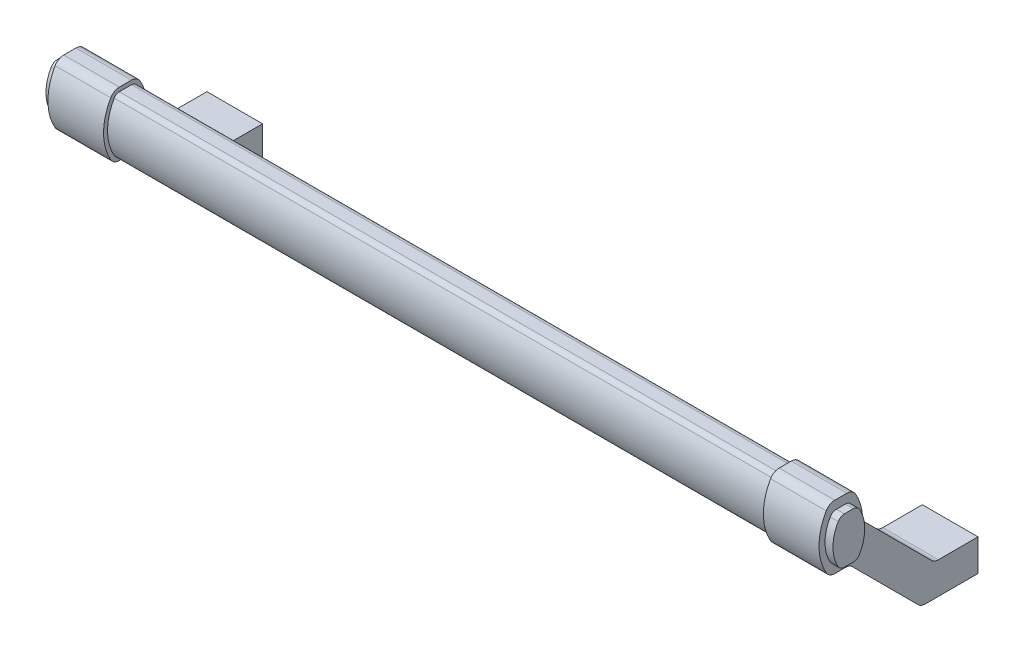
ISO-10303-21;
HEADER;
FILE_DESCRIPTION(('STEP AP214'),'2;1');
FILE_NAME('part.step','',(''),(''),'','','');
FILE_SCHEMA(('AUTOMOTIVE_DESIGN { 1 0 10303 214 1 1 1 1 }'));
ENDSEC;
DATA;
#1=APPLICATION_CONTEXT('core data for automotive mechanical design processes');
#2=APPLICATION_PROTOCOL_DEFINITION('international standard','automotive_design',2000,#1);
#3=PRODUCT_CONTEXT('',#1,'mechanical');
#4=PRODUCT('Part','Part','',(#3));
#5=PRODUCT_RELATED_PRODUCT_CATEGORY('part','',(#4));
#6=PRODUCT_DEFINITION_FORMATION('','',#4);
#7=PRODUCT_DEFINITION_CONTEXT('part definition',#1,'design');
#8=PRODUCT_DEFINITION('design','',#6,#7);
#9=PRODUCT_DEFINITION_SHAPE('','',#8);
#10=(LENGTH_UNIT() NAMED_UNIT(*) SI_UNIT(.MILLI.,.METRE.));
#11=(NAMED_UNIT(*) PLANE_ANGLE_UNIT() SI_UNIT($,.RADIAN.));
#12=(NAMED_UNIT(*) SI_UNIT($,.STERADIAN.) SOLID_ANGLE_UNIT());
#13=UNCERTAINTY_MEASURE_WITH_UNIT(LENGTH_MEASURE(1.E-05),#10,'distance_accuracy_value','');
#14=(GEOMETRIC_REPRESENTATION_CONTEXT(3) GLOBAL_UNCERTAINTY_ASSIGNED_CONTEXT((#13)) GLOBAL_UNIT_ASSIGNED_CONTEXT((#10,
#11,#12)) REPRESENTATION_CONTEXT('',''));
#15=CARTESIAN_POINT('',(0.,0.,0.));
#16=DIRECTION('',(0.,0.,1.));
#17=DIRECTION('',(1.,0.,0.));
#18=AXIS2_PLACEMENT_3D('',#15,#16,#17);
#19=CARTESIAN_POINT('',(-7.,3.6338834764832,0.));
#20=DIRECTION('',(0.,0.,1.));
#21=DIRECTION('',(-1.,0.,0.));
#22=AXIS2_PLACEMENT_3D('',#19,#20,#21);
#23=PLANE('',#22);
#24=CARTESIAN_POINT('',(0.,0.,0.));
#25=DIRECTION('',(0.,0.,-1.));
#26=DIRECTION('',(1.,0.,0.));
#27=AXIS2_PLACEMENT_3D('',#24,#25,#26);
#28=CIRCLE('',#27,2.5);
#29=CARTESIAN_POINT('',(2.5,0.,0.));
#30=VERTEX_POINT('',#29);
#31=EDGE_CURVE('E610',#30,#30,#28,.T.);
#32=ORIENTED_EDGE('',*,*,#31,.F.);
#33=EDGE_LOOP('',(#32));
#34=FACE_BOUND('',#33,.T.);
#35=DIRECTION('',(1.,0.,0.));
#36=VECTOR('',#35,1.);
#37=CARTESIAN_POINT('',(-7.,-4.3661165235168,0.));
#38=LINE('',#37,#36);
#39=CARTESIAN_POINT('',(-7.,-4.3661165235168,0.));
#40=VERTEX_POINT('',#39);
#41=CARTESIAN_POINT('',(7.,-4.3661165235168,0.));
#42=VERTEX_POINT('',#41);
#43=EDGE_CURVE('E9',#40,#42,#38,.T.);
#44=ORIENTED_EDGE('',*,*,#43,.F.);
#45=DIRECTION('',(0.,-1.,0.));
#46=VECTOR('',#45,1.);
#47=CARTESIAN_POINT('',(-7.,3.6338834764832,0.));
#48=LINE('',#47,#46);
#49=CARTESIAN_POINT('',(-7.,3.6338834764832,0.));
#50=VERTEX_POINT('',#49);
#51=EDGE_CURVE('E763',#50,#40,#48,.T.);
#52=ORIENTED_EDGE('',*,*,#51,.F.);
#53=DIRECTION('',(1.,0.,0.));
#54=VECTOR('',#53,1.);
#55=CARTESIAN_POINT('',(-7.,3.6338834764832,0.));
#56=LINE('',#55,#54);
#57=CARTESIAN_POINT('',(7.,3.6338834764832,0.));
#58=VERTEX_POINT('',#57);
#59=EDGE_CURVE('E811',#50,#58,#56,.T.);
#60=ORIENTED_EDGE('',*,*,#59,.T.);
#61=DIRECTION('',(0.,-1.,0.));
#62=VECTOR('',#61,1.);
#63=CARTESIAN_POINT('',(7.,3.6338834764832,0.));
#64=LINE('',#63,#62);
#65=EDGE_CURVE('E715',#58,#42,#64,.T.);
#66=ORIENTED_EDGE('',*,*,#65,.T.);
#67=EDGE_LOOP('',(#44,#52,#60,#66));
#68=FACE_BOUND('',#67,.T.);
#69=ADVANCED_FACE('F14',(#34,#68),#23,.F.);
#70=CARTESIAN_POINT('',(-7.,-4.3661165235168,0.));
#71=DIRECTION('',(0.,1.,0.));
#72=DIRECTION('',(-1.,0.,0.));
#73=AXIS2_PLACEMENT_3D('',#70,#71,#72);
#74=PLANE('',#73);
#75=DIRECTION('',(1.,0.,0.));
#76=VECTOR('',#75,1.);
#77=CARTESIAN_POINT('',(-7.,-4.3661165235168,13.278174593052));
#78=LINE('',#77,#76);
#79=CARTESIAN_POINT('',(-7.,-4.3661165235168,13.278174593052));
#80=VERTEX_POINT('',#79);
#81=CARTESIAN_POINT('',(7.,-4.3661165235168,13.278174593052));
#82=VERTEX_POINT('',#81);
#83=EDGE_CURVE('E22',#80,#82,#78,.T.);
#84=ORIENTED_EDGE('',*,*,#83,.F.);
#85=DIRECTION('',(0.,0.,1.));
#86=VECTOR('',#85,1.);
#87=CARTESIAN_POINT('',(-7.,-4.3661165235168,0.));
#88=LINE('',#87,#86);
#89=EDGE_CURVE('E766',#40,#80,#88,.T.);
#90=ORIENTED_EDGE('',*,*,#89,.F.);
#91=ORIENTED_EDGE('',*,*,#43,.T.);
#92=DIRECTION('',(0.,0.,1.));
#93=VECTOR('',#92,1.);
#94=CARTESIAN_POINT('',(7.,-4.3661165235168,0.));
#95=LINE('',#94,#93);
#96=EDGE_CURVE('E718',#42,#82,#95,.T.);
#97=ORIENTED_EDGE('',*,*,#96,.T.);
#98=EDGE_LOOP('',(#84,#90,#91,#97));
#99=FACE_BOUND('',#98,.T.);
#100=ADVANCED_FACE('F16',(#99),#74,.F.);
#101=CARTESIAN_POINT('',(-7.,-1.86611652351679,13.278174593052));
#102=DIRECTION('',(1.,0.,0.));
#103=DIRECTION('',(0.,1.,0.));
#104=AXIS2_PLACEMENT_3D('',#101,#102,#103);
#105=CYLINDRICAL_SURFACE('',#104,2.49999999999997);
#106=DIRECTION('',(1.,0.,0.));
#107=VECTOR('',#106,1.);
#108=CARTESIAN_POINT('',(-7.,-3.63388347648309,15.0459415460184));
#109=LINE('',#108,#107);
#110=CARTESIAN_POINT('',(-7.,-3.63388347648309,15.0459415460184));
#111=VERTEX_POINT('',#110);
#112=CARTESIAN_POINT('',(7.,-3.63388347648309,15.0459415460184));
#113=VERTEX_POINT('',#112);
#114=EDGE_CURVE('E837',#111,#113,#109,.T.);
#115=ORIENTED_EDGE('',*,*,#114,.F.);
#116=CARTESIAN_POINT('',(-7.,-1.86611652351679,13.278174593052));
#117=DIRECTION('',(-1.,0.,0.));
#118=DIRECTION('',(0.,-1.,0.));
#119=AXIS2_PLACEMENT_3D('',#116,#117,#118);
#120=CIRCLE('',#119,2.49999999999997);
#121=EDGE_CURVE('E769',#80,#111,#120,.T.);
#122=ORIENTED_EDGE('',*,*,#121,.F.);
#123=ORIENTED_EDGE('',*,*,#83,.T.);
#124=CARTESIAN_POINT('',(7.,-1.86611652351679,13.278174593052));
#125=DIRECTION('',(-1.,0.,0.));
#126=DIRECTION('',(0.,-1.,0.));
#127=AXIS2_PLACEMENT_3D('',#124,#125,#126);
#128=CIRCLE('',#127,2.49999999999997);
#129=EDGE_CURVE('E721',#82,#113,#128,.T.);
#130=ORIENTED_EDGE('',*,*,#129,.T.);
#131=EDGE_LOOP('',(#115,#122,#123,#130));
#132=FACE_BOUND('',#131,.T.);
#133=ADVANCED_FACE('F840',(#132),#105,.T.);
#134=CARTESIAN_POINT('',(-7.,12.9016504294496,31.581475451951));
#135=DIRECTION('',(0.,-0.707106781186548,0.707106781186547));
#136=DIRECTION('',(0.,0.707106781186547,0.707106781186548));
#137=AXIS2_PLACEMENT_3D('',#134,#135,#136);
#138=PLANE('',#137);
#139=DIRECTION('',(1.,0.,0.));
#140=VECTOR('',#139,1.);
#141=CARTESIAN_POINT('',(-7.,12.9016504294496,31.581475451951));
#142=LINE('',#141,#140);
#143=CARTESIAN_POINT('',(-7.,12.9016504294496,31.581475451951));
#144=VERTEX_POINT('',#143);
#145=CARTESIAN_POINT('',(7.,12.9016504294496,31.581475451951));
#146=VERTEX_POINT('',#145);
#147=EDGE_CURVE('E835',#144,#146,#142,.T.);
#148=ORIENTED_EDGE('',*,*,#147,.F.);
#149=DIRECTION('',(0.,-0.707106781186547,-0.707106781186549));
#150=VECTOR('',#149,1.);
#151=CARTESIAN_POINT('',(-7.,12.9016504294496,31.581475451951));
#152=LINE('',#151,#150);
#153=EDGE_CURVE('E772',#144,#111,#152,.T.);
#154=ORIENTED_EDGE('',*,*,#153,.T.);
#155=ORIENTED_EDGE('',*,*,#114,.T.);
#156=DIRECTION('',(0.,-0.707106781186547,-0.707106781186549));
#157=VECTOR('',#156,1.);
#158=CARTESIAN_POINT('',(7.,12.9016504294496,31.581475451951));
#159=LINE('',#158,#157);
#160=EDGE_CURVE('E724',#146,#113,#159,.T.);
#161=ORIENTED_EDGE('',*,*,#160,.F.);
#162=EDGE_LOOP('',(#148,#154,#155,#161));
#163=FACE_BOUND('',#162,.T.);
#164=ADVANCED_FACE('F852',(#163),#138,.T.);
#165=CARTESIAN_POINT('',(-7.,11.1338834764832,33.3492424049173));
#166=DIRECTION('',(1.,0.,0.));
#167=DIRECTION('',(0.,1.,0.));
#168=AXIS2_PLACEMENT_3D('',#165,#166,#167);
#169=CYLINDRICAL_SURFACE('',#168,2.5);
#170=DIRECTION('',(1.,0.,0.));
#171=VECTOR('',#170,1.);
#172=CARTESIAN_POINT('',(-7.,13.6338834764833,33.3492424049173));
#173=LINE('',#172,#171);
#174=CARTESIAN_POINT('',(-7.,13.6338834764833,33.3492424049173));
#175=VERTEX_POINT('',#174);
#176=CARTESIAN_POINT('',(7.,13.6338834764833,33.3492424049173));
#177=VERTEX_POINT('',#176);
#178=EDGE_CURVE('E833',#175,#177,#173,.T.);
#179=ORIENTED_EDGE('',*,*,#178,.F.);
#180=CARTESIAN_POINT('',(-7.,11.1338834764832,33.3492424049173));
#181=DIRECTION('',(-1.,0.,0.));
#182=DIRECTION('',(0.,-1.,0.));
#183=AXIS2_PLACEMENT_3D('',#180,#181,#182);
#184=CIRCLE('',#183,2.5);
#185=EDGE_CURVE('E775',#175,#144,#184,.T.);
#186=ORIENTED_EDGE('',*,*,#185,.T.);
#187=ORIENTED_EDGE('',*,*,#147,.T.);
#188=CARTESIAN_POINT('',(7.,11.1338834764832,33.3492424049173));
#189=DIRECTION('',(-1.,0.,0.));
#190=DIRECTION('',(0.,-1.,0.));
#191=AXIS2_PLACEMENT_3D('',#188,#189,#190);
#192=CIRCLE('',#191,2.5);
#193=EDGE_CURVE('E727',#177,#146,#192,.T.);
#194=ORIENTED_EDGE('',*,*,#193,.F.);
#195=EDGE_LOOP('',(#179,#186,#187,#194));
#196=FACE_BOUND('',#195,.T.);
#197=ADVANCED_FACE('F903',(#196),#169,.F.);
#198=CARTESIAN_POINT('',(-7.,13.6338834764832,33.3492424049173));
#199=DIRECTION('',(0.,1.,0.));
#200=DIRECTION('',(-1.,0.,0.));
#201=AXIS2_PLACEMENT_3D('',#198,#199,#200);
#202=PLANE('',#201);
#203=DIRECTION('',(1.,0.,0.));
#204=VECTOR('',#203,1.);
#205=CARTESIAN_POINT('',(-7.,13.6338834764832,36.0262794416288));
#206=LINE('',#205,#204);
#207=CARTESIAN_POINT('',(-7.,13.6338834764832,36.0262794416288));
#208=VERTEX_POINT('',#207);
#209=CARTESIAN_POINT('',(7.,13.6338834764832,36.0262794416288));
#210=VERTEX_POINT('',#209);
#211=EDGE_CURVE('E831',#208,#210,#206,.T.);
#212=ORIENTED_EDGE('',*,*,#211,.F.);
#213=DIRECTION('',(0.,0.,1.));
#214=VECTOR('',#213,1.);
#215=CARTESIAN_POINT('',(-7.,13.6338834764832,33.3492424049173));
#216=LINE('',#215,#214);
#217=EDGE_CURVE('E778',#175,#208,#216,.T.);
#218=ORIENTED_EDGE('',*,*,#217,.F.);
#219=ORIENTED_EDGE('',*,*,#178,.T.);
#220=DIRECTION('',(0.,0.,1.));
#221=VECTOR('',#220,1.);
#222=CARTESIAN_POINT('',(7.,13.6338834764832,33.3492424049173));
#223=LINE('',#222,#221);
#224=EDGE_CURVE('E730',#177,#210,#223,.T.);
#225=ORIENTED_EDGE('',*,*,#224,.T.);
#226=EDGE_LOOP('',(#212,#218,#219,#225));
#227=FACE_BOUND('',#226,.T.);
#228=ADVANCED_FACE('F901',(#227),#202,.F.);
#229=CARTESIAN_POINT('',(-7.,16.1338834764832,36.0262794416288));
#230=DIRECTION('',(1.,0.,0.));
#231=DIRECTION('',(0.,1.,0.));
#232=AXIS2_PLACEMENT_3D('',#229,#230,#231);
#233=CYLINDRICAL_SURFACE('',#232,2.5);
#234=DIRECTION('',(1.,0.,0.));
#235=VECTOR('',#234,1.);
#236=CARTESIAN_POINT('',(-7.,14.8838834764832,38.1913429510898));
#237=LINE('',#236,#235);
#238=CARTESIAN_POINT('',(-7.,14.8838834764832,38.1913429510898));
#239=VERTEX_POINT('',#238);
#240=CARTESIAN_POINT('',(7.,14.8838834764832,38.1913429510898));
#241=VERTEX_POINT('',#240);
#242=EDGE_CURVE('E829',#239,#241,#237,.T.);
#243=ORIENTED_EDGE('',*,*,#242,.F.);
#244=CARTESIAN_POINT('',(-7.,16.1338834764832,36.0262794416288));
#245=DIRECTION('',(-1.,0.,0.));
#246=DIRECTION('',(0.,-1.,0.));
#247=AXIS2_PLACEMENT_3D('',#244,#245,#246);
#248=CIRCLE('',#247,2.5);
#249=EDGE_CURVE('E781',#208,#239,#248,.T.);
#250=ORIENTED_EDGE('',*,*,#249,.F.);
#251=ORIENTED_EDGE('',*,*,#211,.T.);
#252=CARTESIAN_POINT('',(7.,16.1338834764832,36.0262794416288));
#253=DIRECTION('',(-1.,0.,0.));
#254=DIRECTION('',(0.,-1.,0.));
#255=AXIS2_PLACEMENT_3D('',#252,#253,#254);
#256=CIRCLE('',#255,2.5);
#257=EDGE_CURVE('E733',#210,#241,#256,.T.);
#258=ORIENTED_EDGE('',*,*,#257,.T.);
#259=EDGE_LOOP('',(#243,#250,#251,#258));
#260=FACE_BOUND('',#259,.T.);
#261=ADVANCED_FACE('F898',(#260),#233,.T.);
#262=CARTESIAN_POINT('',(-7.,21.6338834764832,26.5));
#263=DIRECTION('',(1.,0.,0.));
#264=DIRECTION('',(0.,1.,0.));
#265=AXIS2_PLACEMENT_3D('',#262,#263,#264);
#266=CYLINDRICAL_SURFACE('',#265,13.5);
#267=DIRECTION('',(1.,0.,0.));
#268=VECTOR('',#267,1.);
#269=CARTESIAN_POINT('',(-7.,28.3838834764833,38.1913429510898));
#270=LINE('',#269,#268);
#271=CARTESIAN_POINT('',(-7.,28.3838834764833,38.1913429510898));
#272=VERTEX_POINT('',#271);
#273=CARTESIAN_POINT('',(7.,28.3838834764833,38.1913429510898));
#274=VERTEX_POINT('',#273);
#275=EDGE_CURVE('E827',#272,#274,#270,.T.);
#276=ORIENTED_EDGE('',*,*,#275,.F.);
#277=CARTESIAN_POINT('',(-7.,21.6338834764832,26.5));
#278=DIRECTION('',(-1.,0.,0.));
#279=DIRECTION('',(0.,-1.,0.));
#280=AXIS2_PLACEMENT_3D('',#277,#278,#279);
#281=CIRCLE('',#280,13.5);
#282=EDGE_CURVE('E784',#239,#272,#281,.T.);
#283=ORIENTED_EDGE('',*,*,#282,.F.);
#284=ORIENTED_EDGE('',*,*,#242,.T.);
#285=CARTESIAN_POINT('',(7.,21.6338834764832,26.5));
#286=DIRECTION('',(-1.,0.,0.));
#287=DIRECTION('',(0.,-1.,0.));
#288=AXIS2_PLACEMENT_3D('',#285,#286,#287);
#289=CIRCLE('',#288,13.5);
#290=EDGE_CURVE('E736',#241,#274,#289,.T.);
#291=ORIENTED_EDGE('',*,*,#290,.T.);
#292=EDGE_LOOP('',(#276,#283,#284,#291));
#293=FACE_BOUND('',#292,.T.);
#294=ADVANCED_FACE('F894',(#293),#266,.T.);
#295=CARTESIAN_POINT('',(-7.,27.1338834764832,36.0262794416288));
#296=DIRECTION('',(1.,0.,0.));
#297=DIRECTION('',(0.,1.,0.));
#298=AXIS2_PLACEMENT_3D('',#295,#296,#297);
#299=CYLINDRICAL_SURFACE('',#298,2.5);
#300=DIRECTION('',(1.,0.,0.));
#301=VECTOR('',#300,1.);
#302=CARTESIAN_POINT('',(-7.,29.6338834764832,36.0262794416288));
#303=LINE('',#302,#301);
#304=CARTESIAN_POINT('',(-7.,29.6338834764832,36.0262794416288));
#305=VERTEX_POINT('',#304);
#306=CARTESIAN_POINT('',(7.,29.6338834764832,36.0262794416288));
#307=VERTEX_POINT('',#306);
#308=EDGE_CURVE('E825',#305,#307,#303,.T.);
#309=ORIENTED_EDGE('',*,*,#308,.F.);
#310=CARTESIAN_POINT('',(-7.,27.1338834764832,36.0262794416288));
#311=DIRECTION('',(-1.,0.,0.));
#312=DIRECTION('',(0.,-1.,0.));
#313=AXIS2_PLACEMENT_3D('',#310,#311,#312);
#314=CIRCLE('',#313,2.5);
#315=EDGE_CURVE('E787',#272,#305,#314,.T.);
#316=ORIENTED_EDGE('',*,*,#315,.F.);
#317=ORIENTED_EDGE('',*,*,#275,.T.);
#318=CARTESIAN_POINT('',(7.,27.1338834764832,36.0262794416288));
#319=DIRECTION('',(-1.,0.,0.));
#320=DIRECTION('',(0.,-1.,0.));
#321=AXIS2_PLACEMENT_3D('',#318,#319,#320);
#322=CIRCLE('',#321,2.5);
#323=EDGE_CURVE('E739',#274,#307,#322,.T.);
#324=ORIENTED_EDGE('',*,*,#323,.T.);
#325=EDGE_LOOP('',(#309,#316,#317,#324));
#326=FACE_BOUND('',#325,.T.);
#327=ADVANCED_FACE('F890',(#326),#299,.T.);
#328=CARTESIAN_POINT('',(-7.,29.6338834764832,32.9737205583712));
#329=DIRECTION('',(0.,1.,0.));
#330=DIRECTION('',(-1.,0.,0.));
#331=AXIS2_PLACEMENT_3D('',#328,#329,#330);
#332=PLANE('',#331);
#333=DIRECTION('',(1.,0.,0.));
#334=VECTOR('',#333,1.);
#335=CARTESIAN_POINT('',(-7.,29.6338834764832,32.9737205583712));
#336=LINE('',#335,#334);
#337=CARTESIAN_POINT('',(-7.,29.6338834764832,32.9737205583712));
#338=VERTEX_POINT('',#337);
#339=CARTESIAN_POINT('',(7.,29.6338834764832,32.9737205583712));
#340=VERTEX_POINT('',#339);
#341=EDGE_CURVE('E823',#338,#340,#336,.T.);
#342=ORIENTED_EDGE('',*,*,#341,.F.);
#343=DIRECTION('',(0.,0.,1.));
#344=VECTOR('',#343,1.);
#345=CARTESIAN_POINT('',(-7.,29.6338834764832,32.9737205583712));
#346=LINE('',#345,#344);
#347=EDGE_CURVE('E790',#338,#305,#346,.T.);
#348=ORIENTED_EDGE('',*,*,#347,.T.);
#349=ORIENTED_EDGE('',*,*,#308,.T.);
#350=DIRECTION('',(0.,0.,1.));
#351=VECTOR('',#350,1.);
#352=CARTESIAN_POINT('',(7.,29.6338834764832,32.9737205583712));
#353=LINE('',#352,#351);
#354=EDGE_CURVE('E742',#340,#307,#353,.T.);
#355=ORIENTED_EDGE('',*,*,#354,.F.);
#356=EDGE_LOOP('',(#342,#348,#349,#355));
#357=FACE_BOUND('',#356,.T.);
#358=ADVANCED_FACE('F887',(#357),#332,.T.);
#359=CARTESIAN_POINT('',(-7.,27.1338834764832,32.9737205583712));
#360=DIRECTION('',(1.,0.,0.));
#361=DIRECTION('',(0.,1.,0.));
#362=AXIS2_PLACEMENT_3D('',#359,#360,#361);
#363=CYLINDRICAL_SURFACE('',#362,2.5);
#364=DIRECTION('',(1.,0.,0.));
#365=VECTOR('',#364,1.);
#366=CARTESIAN_POINT('',(-7.,28.3838834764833,30.80865704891));
#367=LINE('',#366,#365);
#368=CARTESIAN_POINT('',(-7.,28.3838834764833,30.80865704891));
#369=VERTEX_POINT('',#368);
#370=CARTESIAN_POINT('',(7.,28.3838834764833,30.80865704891));
#371=VERTEX_POINT('',#370);
#372=EDGE_CURVE('E821',#369,#371,#367,.T.);
#373=ORIENTED_EDGE('',*,*,#372,.F.);
#374=CARTESIAN_POINT('',(-7.,27.1338834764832,32.9737205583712));
#375=DIRECTION('',(-1.,0.,0.));
#376=DIRECTION('',(0.,-1.,0.));
#377=AXIS2_PLACEMENT_3D('',#374,#375,#376);
#378=CIRCLE('',#377,2.5);
#379=EDGE_CURVE('E793',#338,#369,#378,.T.);
#380=ORIENTED_EDGE('',*,*,#379,.F.);
#381=ORIENTED_EDGE('',*,*,#341,.T.);
#382=CARTESIAN_POINT('',(7.,27.1338834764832,32.9737205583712));
#383=DIRECTION('',(-1.,0.,0.));
#384=DIRECTION('',(0.,-1.,0.));
#385=AXIS2_PLACEMENT_3D('',#382,#383,#384);
#386=CIRCLE('',#385,2.5);
#387=EDGE_CURVE('E745',#340,#371,#386,.T.);
#388=ORIENTED_EDGE('',*,*,#387,.T.);
#389=EDGE_LOOP('',(#373,#380,#381,#388));
#390=FACE_BOUND('',#389,.T.);
#391=ADVANCED_FACE('F883',(#390),#363,.T.);
#392=CARTESIAN_POINT('',(-7.,21.6338834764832,42.5));
#393=DIRECTION('',(1.,0.,0.));
#394=DIRECTION('',(0.,1.,0.));
#395=AXIS2_PLACEMENT_3D('',#392,#393,#394);
#396=CYLINDRICAL_SURFACE('',#395,13.5);
#397=DIRECTION('',(1.,0.,0.));
#398=VECTOR('',#397,1.);
#399=CARTESIAN_POINT('',(-7.,22.5379188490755,29.0303036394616));
#400=LINE('',#399,#398);
#401=CARTESIAN_POINT('',(-7.,22.5379188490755,29.0303036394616));
#402=VERTEX_POINT('',#401);
#403=CARTESIAN_POINT('',(7.,22.5379188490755,29.0303036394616));
#404=VERTEX_POINT('',#403);
#405=EDGE_CURVE('E819',#402,#404,#400,.T.);
#406=ORIENTED_EDGE('',*,*,#405,.F.);
#407=CARTESIAN_POINT('',(-7.,21.6338834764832,42.5));
#408=DIRECTION('',(-1.,0.,0.));
#409=DIRECTION('',(0.,-1.,0.));
#410=AXIS2_PLACEMENT_3D('',#407,#408,#409);
#411=CIRCLE('',#410,13.5);
#412=EDGE_CURVE('E796',#369,#402,#411,.T.);
#413=ORIENTED_EDGE('',*,*,#412,.F.);
#414=ORIENTED_EDGE('',*,*,#372,.T.);
#415=CARTESIAN_POINT('',(7.,21.6338834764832,42.5));
#416=DIRECTION('',(-1.,0.,0.));
#417=DIRECTION('',(0.,-1.,0.));
#418=AXIS2_PLACEMENT_3D('',#415,#416,#417);
#419=CIRCLE('',#418,13.5);
#420=EDGE_CURVE('E748',#371,#404,#419,.T.);
#421=ORIENTED_EDGE('',*,*,#420,.T.);
#422=EDGE_LOOP('',(#406,#413,#414,#421));
#423=FACE_BOUND('',#422,.T.);
#424=ADVANCED_FACE('F878',(#423),#396,.T.);
#425=CARTESIAN_POINT('',(-7.,22.705332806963,26.535915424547));
#426=DIRECTION('',(1.,0.,0.));
#427=DIRECTION('',(0.,1.,0.));
#428=AXIS2_PLACEMENT_3D('',#425,#426,#427);
#429=CYLINDRICAL_SURFACE('',#428,2.5);
#430=DIRECTION('',(1.,0.,0.));
#431=VECTOR('',#430,1.);
#432=CARTESIAN_POINT('',(-7.,20.9375658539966,28.3036823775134));
#433=LINE('',#432,#431);
#434=CARTESIAN_POINT('',(-7.,20.9375658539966,28.3036823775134));
#435=VERTEX_POINT('',#434);
#436=CARTESIAN_POINT('',(7.,20.9375658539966,28.3036823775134));
#437=VERTEX_POINT('',#436);
#438=EDGE_CURVE('E817',#435,#437,#433,.T.);
#439=ORIENTED_EDGE('',*,*,#438,.F.);
#440=CARTESIAN_POINT('',(-7.,22.705332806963,26.535915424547));
#441=DIRECTION('',(-1.,0.,0.));
#442=DIRECTION('',(0.,-1.,0.));
#443=AXIS2_PLACEMENT_3D('',#440,#441,#442);
#444=CIRCLE('',#443,2.5);
#445=EDGE_CURVE('E799',#435,#402,#444,.T.);
#446=ORIENTED_EDGE('',*,*,#445,.T.);
#447=ORIENTED_EDGE('',*,*,#405,.T.);
#448=CARTESIAN_POINT('',(7.,22.705332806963,26.535915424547));
#449=DIRECTION('',(-1.,0.,0.));
#450=DIRECTION('',(0.,-1.,0.));
#451=AXIS2_PLACEMENT_3D('',#448,#449,#450);
#452=CIRCLE('',#451,2.5);
#453=EDGE_CURVE('E751',#437,#404,#452,.T.);
#454=ORIENTED_EDGE('',*,*,#453,.F.);
#455=EDGE_LOOP('',(#439,#446,#447,#454));
#456=FACE_BOUND('',#455,.T.);
#457=ADVANCED_FACE('F875',(#456),#429,.F.);
#458=CARTESIAN_POINT('',(-7.,20.9375658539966,28.3036823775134));
#459=DIRECTION('',(0.,-0.707106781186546,0.707106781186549));
#460=DIRECTION('',(0.,0.707106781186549,0.707106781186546));
#461=AXIS2_PLACEMENT_3D('',#458,#459,#460);
#462=PLANE('',#461);
#463=DIRECTION('',(1.,0.,0.));
#464=VECTOR('',#463,1.);
#465=CARTESIAN_POINT('',(-7.,4.3661165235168,11.7322330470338));
#466=LINE('',#465,#464);
#467=CARTESIAN_POINT('',(-7.,4.3661165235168,11.7322330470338));
#468=VERTEX_POINT('',#467);
#469=CARTESIAN_POINT('',(7.,4.3661165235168,11.7322330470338));
#470=VERTEX_POINT('',#469);
#471=EDGE_CURVE('E815',#468,#470,#466,.T.);
#472=ORIENTED_EDGE('',*,*,#471,.F.);
#473=DIRECTION('',(0.,-0.707106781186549,-0.707106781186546));
#474=VECTOR('',#473,1.);
#475=CARTESIAN_POINT('',(-7.,20.9375658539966,28.3036823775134));
#476=LINE('',#475,#474);
#477=EDGE_CURVE('E802',#435,#468,#476,.T.);
#478=ORIENTED_EDGE('',*,*,#477,.F.);
#479=ORIENTED_EDGE('',*,*,#438,.T.);
#480=DIRECTION('',(0.,-0.707106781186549,-0.707106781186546));
#481=VECTOR('',#480,1.);
#482=CARTESIAN_POINT('',(7.,20.9375658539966,28.3036823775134));
#483=LINE('',#482,#481);
#484=EDGE_CURVE('E754',#437,#470,#483,.T.);
#485=ORIENTED_EDGE('',*,*,#484,.T.);
#486=EDGE_LOOP('',(#472,#478,#479,#485));
#487=FACE_BOUND('',#486,.T.);
#488=ADVANCED_FACE('F871',(#487),#462,.F.);
#489=CARTESIAN_POINT('',(-7.,6.13388347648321,9.9644660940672));
#490=DIRECTION('',(1.,0.,0.));
#491=DIRECTION('',(0.,1.,0.));
#492=AXIS2_PLACEMENT_3D('',#489,#490,#491);
#493=CYLINDRICAL_SURFACE('',#492,2.5);
#494=DIRECTION('',(1.,0.,0.));
#495=VECTOR('',#494,1.);
#496=CARTESIAN_POINT('',(-7.,3.6338834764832,9.9644660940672));
#497=LINE('',#496,#495);
#498=CARTESIAN_POINT('',(-7.,3.6338834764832,9.9644660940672));
#499=VERTEX_POINT('',#498);
#500=CARTESIAN_POINT('',(7.,3.6338834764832,9.9644660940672));
#501=VERTEX_POINT('',#500);
#502=EDGE_CURVE('E813',#499,#501,#497,.T.);
#503=ORIENTED_EDGE('',*,*,#502,.F.);
#504=CARTESIAN_POINT('',(-7.,6.13388347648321,9.9644660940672));
#505=DIRECTION('',(-1.,0.,0.));
#506=DIRECTION('',(0.,-1.,0.));
#507=AXIS2_PLACEMENT_3D('',#504,#505,#506);
#508=CIRCLE('',#507,2.5);
#509=EDGE_CURVE('E805',#499,#468,#508,.T.);
#510=ORIENTED_EDGE('',*,*,#509,.T.);
#511=ORIENTED_EDGE('',*,*,#471,.T.);
#512=CARTESIAN_POINT('',(7.,6.13388347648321,9.9644660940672));
#513=DIRECTION('',(-1.,0.,0.));
#514=DIRECTION('',(0.,-1.,0.));
#515=AXIS2_PLACEMENT_3D('',#512,#513,#514);
#516=CIRCLE('',#515,2.5);
#517=EDGE_CURVE('E757',#501,#470,#516,.T.);
#518=ORIENTED_EDGE('',*,*,#517,.F.);
#519=EDGE_LOOP('',(#503,#510,#511,#518));
#520=FACE_BOUND('',#519,.T.);
#521=ADVANCED_FACE('F866',(#520),#493,.F.);
#522=CARTESIAN_POINT('',(-7.,3.6338834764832,0.));
#523=DIRECTION('',(0.,1.,0.));
#524=DIRECTION('',(-1.,0.,0.));
#525=AXIS2_PLACEMENT_3D('',#522,#523,#524);
#526=PLANE('',#525);
#527=DIRECTION('',(0.,0.,1.));
#528=VECTOR('',#527,1.);
#529=CARTESIAN_POINT('',(-7.,3.6338834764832,0.));
#530=LINE('',#529,#528);
#531=EDGE_CURVE('E808',#50,#499,#530,.T.);
#532=ORIENTED_EDGE('',*,*,#531,.T.);
#533=ORIENTED_EDGE('',*,*,#502,.T.);
#534=DIRECTION('',(0.,0.,1.));
#535=VECTOR('',#534,1.);
#536=CARTESIAN_POINT('',(7.,3.6338834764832,0.));
#537=LINE('',#536,#535);
#538=EDGE_CURVE('E760',#58,#501,#537,.T.);
#539=ORIENTED_EDGE('',*,*,#538,.F.);
#540=ORIENTED_EDGE('',*,*,#59,.F.);
#541=EDGE_LOOP('',(#532,#533,#539,#540));
#542=FACE_BOUND('',#541,.T.);
#543=ADVANCED_FACE('F863',(#542),#526,.T.);
#544=CARTESIAN_POINT('',(-7.,-1.86611652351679,13.278174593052));
#545=DIRECTION('',(-1.,0.,0.));
#546=DIRECTION('',(0.,-1.,0.));
#547=AXIS2_PLACEMENT_3D('',#544,#545,#546);
#548=PLANE('',#547);
#549=CARTESIAN_POINT('',(-7.,17.6338834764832,35.6100214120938));
#550=DIRECTION('',(-1.,0.,0.));
#551=DIRECTION('',(0.,-1.,0.));
#552=AXIS2_PLACEMENT_3D('',#549,#550,#551);
#553=CIRCLE('',#552,1.81818181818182);
#554=CARTESIAN_POINT('',(-7.,15.8157016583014,35.6100214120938));
#555=VERTEX_POINT('',#554);
#556=CARTESIAN_POINT('',(-7.,16.7247925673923,37.1846130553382));
#557=VERTEX_POINT('',#556);
#558=EDGE_CURVE('E37',#555,#557,#553,.T.);
#559=ORIENTED_EDGE('',*,*,#558,.F.);
#560=DIRECTION('',(0.,0.,1.));
#561=VECTOR('',#560,1.);
#562=CARTESIAN_POINT('',(-7.,15.8157016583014,33.3899785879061));
#563=LINE('',#562,#561);
#564=CARTESIAN_POINT('',(-7.,15.8157016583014,33.3899785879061));
#565=VERTEX_POINT('',#564);
#566=EDGE_CURVE('E665',#565,#555,#563,.T.);
#567=ORIENTED_EDGE('',*,*,#566,.F.);
#568=CARTESIAN_POINT('',(-7.,17.6338834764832,33.3899785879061));
#569=DIRECTION('',(-1.,0.,0.));
#570=DIRECTION('',(0.,-1.,0.));
#571=AXIS2_PLACEMENT_3D('',#568,#569,#570);
#572=CIRCLE('',#571,1.81818181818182);
#573=CARTESIAN_POINT('',(-7.,16.7247925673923,31.8153869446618));
#574=VERTEX_POINT('',#573);
#575=EDGE_CURVE('E662',#574,#565,#572,.T.);
#576=ORIENTED_EDGE('',*,*,#575,.F.);
#577=CARTESIAN_POINT('',(-7.,21.6338834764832,40.3181818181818));
#578=DIRECTION('',(-1.,0.,0.));
#579=DIRECTION('',(0.,-1.,0.));
#580=AXIS2_PLACEMENT_3D('',#577,#578,#579);
#581=CIRCLE('',#580,9.81818181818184);
#582=CARTESIAN_POINT('',(-7.,26.5429743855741,31.8153869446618));
#583=VERTEX_POINT('',#582);
#584=EDGE_CURVE('E659',#583,#574,#581,.T.);
#585=ORIENTED_EDGE('',*,*,#584,.F.);
#586=CARTESIAN_POINT('',(-7.,25.6338834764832,33.3899785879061));
#587=DIRECTION('',(-1.,0.,0.));
#588=DIRECTION('',(0.,-1.,0.));
#589=AXIS2_PLACEMENT_3D('',#586,#587,#588);
#590=CIRCLE('',#589,1.81818181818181);
#591=CARTESIAN_POINT('',(-7.,27.4520652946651,33.3899785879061));
#592=VERTEX_POINT('',#591);
#593=EDGE_CURVE('E656',#592,#583,#590,.T.);
#594=ORIENTED_EDGE('',*,*,#593,.F.);
#595=DIRECTION('',(0.,0.,1.));
#596=VECTOR('',#595,1.);
#597=CARTESIAN_POINT('',(-7.,27.4520652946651,33.3899785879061));
#598=LINE('',#597,#596);
#599=CARTESIAN_POINT('',(-7.,27.4520652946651,35.6100214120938));
#600=VERTEX_POINT('',#599);
#601=EDGE_CURVE('E654',#592,#600,#598,.T.);
#602=ORIENTED_EDGE('',*,*,#601,.T.);
#603=CARTESIAN_POINT('',(-7.,25.6338834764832,35.6100214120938));
#604=DIRECTION('',(-1.,0.,0.));
#605=DIRECTION('',(0.,-1.,0.));
#606=AXIS2_PLACEMENT_3D('',#603,#604,#605);
#607=CIRCLE('',#606,1.81818181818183);
#608=CARTESIAN_POINT('',(-7.,26.5429743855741,37.1846130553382));
#609=VERTEX_POINT('',#608);
#610=EDGE_CURVE('E651',#609,#600,#607,.T.);
#611=ORIENTED_EDGE('',*,*,#610,.F.);
#612=CARTESIAN_POINT('',(-7.,21.6338834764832,28.6818181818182));
#613=DIRECTION('',(-1.,0.,0.));
#614=DIRECTION('',(0.,-1.,0.));
#615=AXIS2_PLACEMENT_3D('',#612,#613,#614);
#616=CIRCLE('',#615,9.81818181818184);
#617=EDGE_CURVE('E648',#557,#609,#616,.T.);
#618=ORIENTED_EDGE('',*,*,#617,.F.);
#619=EDGE_LOOP('',(#559,#567,#576,#585,#594,#602,#611,#618));
#620=FACE_BOUND('',#619,.T.);
#621=ORIENTED_EDGE('',*,*,#51,.T.);
#622=ORIENTED_EDGE('',*,*,#89,.T.);
#623=ORIENTED_EDGE('',*,*,#121,.T.);
#624=ORIENTED_EDGE('',*,*,#153,.F.);
#625=ORIENTED_EDGE('',*,*,#185,.F.);
#626=ORIENTED_EDGE('',*,*,#217,.T.);
#627=ORIENTED_EDGE('',*,*,#249,.T.);
#628=ORIENTED_EDGE('',*,*,#282,.T.);
#629=ORIENTED_EDGE('',*,*,#315,.T.);
#630=ORIENTED_EDGE('',*,*,#347,.F.);
#631=ORIENTED_EDGE('',*,*,#379,.T.);
#632=ORIENTED_EDGE('',*,*,#412,.T.);
#633=ORIENTED_EDGE('',*,*,#445,.F.);
#634=ORIENTED_EDGE('',*,*,#477,.T.);
#635=ORIENTED_EDGE('',*,*,#509,.F.);
#636=ORIENTED_EDGE('',*,*,#531,.F.);
#637=EDGE_LOOP('',(#621,#622,#623,#624,#625,#626,#627,#628,#629,#630,#631,#632,#633,#634,#635,#636));
#638=FACE_BOUND('',#637,.T.);
#639=ADVANCED_FACE('F855',(#620,#638),#548,.T.);
#640=CARTESIAN_POINT('',(7.,-1.86611652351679,13.278174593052));
#641=DIRECTION('',(-1.,0.,0.));
#642=DIRECTION('',(0.,-1.,0.));
#643=AXIS2_PLACEMENT_3D('',#640,#641,#642);
#644=PLANE('',#643);
#645=CARTESIAN_POINT('',(7.,27.1338834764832,32.973720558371));
#646=DIRECTION('',(-1.,0.,0.));
#647=DIRECTION('',(0.,-1.,0.));
#648=AXIS2_PLACEMENT_3D('',#645,#646,#647);
#649=CIRCLE('',#648,1.49999999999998);
#650=CARTESIAN_POINT('',(7.,28.6338834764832,32.9737205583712));
#651=VERTEX_POINT('',#650);
#652=CARTESIAN_POINT('',(7.,27.8838834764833,31.6746824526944));
#653=VERTEX_POINT('',#652);
#654=EDGE_CURVE('E374',#651,#653,#649,.T.);
#655=ORIENTED_EDGE('',*,*,#654,.T.);
#656=CARTESIAN_POINT('',(7.,21.6338834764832,42.5));
#657=DIRECTION('',(-1.,0.,0.));
#658=DIRECTION('',(0.,-1.,0.));
#659=AXIS2_PLACEMENT_3D('',#656,#657,#658);
#660=CIRCLE('',#659,12.5);
#661=CARTESIAN_POINT('',(7.,15.3838834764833,31.6746824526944));
#662=VERTEX_POINT('',#661);
#663=EDGE_CURVE('E29',#653,#662,#660,.T.);
#664=ORIENTED_EDGE('',*,*,#663,.T.);
#665=CARTESIAN_POINT('',(7.,16.1338834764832,32.973720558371));
#666=DIRECTION('',(-1.,0.,0.));
#667=DIRECTION('',(0.,-1.,0.));
#668=AXIS2_PLACEMENT_3D('',#665,#666,#667);
#669=CIRCLE('',#668,1.49999999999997);
#670=CARTESIAN_POINT('',(7.,14.6338834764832,32.973720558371));
#671=VERTEX_POINT('',#670);
#672=EDGE_CURVE('E371',#662,#671,#669,.T.);
#673=ORIENTED_EDGE('',*,*,#672,.T.);
#674=DIRECTION('',(0.,0.,1.));
#675=VECTOR('',#674,1.);
#676=CARTESIAN_POINT('',(7.,14.6338834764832,32.973720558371));
#677=LINE('',#676,#675);
#678=CARTESIAN_POINT('',(7.,14.6338834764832,36.0262794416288));
#679=VERTEX_POINT('',#678);
#680=EDGE_CURVE('E618',#671,#679,#677,.T.);
#681=ORIENTED_EDGE('',*,*,#680,.T.);
#682=CARTESIAN_POINT('',(7.,16.1338834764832,36.0262794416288));
#683=DIRECTION('',(1.,0.,0.));
#684=DIRECTION('',(0.,1.,0.));
#685=AXIS2_PLACEMENT_3D('',#682,#683,#684);
#686=CIRCLE('',#685,1.49999999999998);
#687=CARTESIAN_POINT('',(7.,15.3838834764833,37.3253175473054));
#688=VERTEX_POINT('',#687);
#689=EDGE_CURVE('E621',#688,#679,#686,.T.);
#690=ORIENTED_EDGE('',*,*,#689,.F.);
#691=CARTESIAN_POINT('',(7.,21.6338834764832,26.5));
#692=DIRECTION('',(1.,0.,0.));
#693=DIRECTION('',(0.,1.,0.));
#694=AXIS2_PLACEMENT_3D('',#691,#692,#693);
#695=CIRCLE('',#694,12.5);
#696=CARTESIAN_POINT('',(7.,27.8838834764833,37.3253175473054));
#697=VERTEX_POINT('',#696);
#698=EDGE_CURVE('E624',#697,#688,#695,.T.);
#699=ORIENTED_EDGE('',*,*,#698,.F.);
#700=CARTESIAN_POINT('',(7.,27.1338834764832,36.0262794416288));
#701=DIRECTION('',(1.,0.,0.));
#702=DIRECTION('',(0.,1.,0.));
#703=AXIS2_PLACEMENT_3D('',#700,#701,#702);
#704=CIRCLE('',#703,1.5);
#705=CARTESIAN_POINT('',(7.,28.6338834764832,36.0262794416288));
#706=VERTEX_POINT('',#705);
#707=EDGE_CURVE('E627',#706,#697,#704,.T.);
#708=ORIENTED_EDGE('',*,*,#707,.F.);
#709=DIRECTION('',(0.,0.,1.));
#710=VECTOR('',#709,1.);
#711=CARTESIAN_POINT('',(7.,28.6338834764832,32.9737205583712));
#712=LINE('',#711,#710);
#713=EDGE_CURVE('E630',#651,#706,#712,.T.);
#714=ORIENTED_EDGE('',*,*,#713,.F.);
#715=EDGE_LOOP('',(#655,#664,#673,#681,#690,#699,#708,#714));
#716=FACE_BOUND('',#715,.T.);
#717=ORIENTED_EDGE('',*,*,#65,.F.);
#718=ORIENTED_EDGE('',*,*,#538,.T.);
#719=ORIENTED_EDGE('',*,*,#517,.T.);
#720=ORIENTED_EDGE('',*,*,#484,.F.);
#721=ORIENTED_EDGE('',*,*,#453,.T.);
#722=ORIENTED_EDGE('',*,*,#420,.F.);
#723=ORIENTED_EDGE('',*,*,#387,.F.);
#724=ORIENTED_EDGE('',*,*,#354,.T.);
#725=ORIENTED_EDGE('',*,*,#323,.F.);
#726=ORIENTED_EDGE('',*,*,#290,.F.);
#727=ORIENTED_EDGE('',*,*,#257,.F.);
#728=ORIENTED_EDGE('',*,*,#224,.F.);
#729=ORIENTED_EDGE('',*,*,#193,.T.);
#730=ORIENTED_EDGE('',*,*,#160,.T.);
#731=ORIENTED_EDGE('',*,*,#129,.F.);
#732=ORIENTED_EDGE('',*,*,#96,.F.);
#733=EDGE_LOOP('',(#717,#718,#719,#720,#721,#722,#723,#724,#725,#726,#727,#728,#729,#730,#731,#732));
#734=FACE_BOUND('',#733,.T.);
#735=ADVANCED_FACE('F847',(#716,#734),#644,.F.);
#736=CARTESIAN_POINT('',(-9.,17.6338834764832,35.6100214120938));
#737=DIRECTION('',(1.,0.,0.));
#738=DIRECTION('',(0.,1.,0.));
#739=AXIS2_PLACEMENT_3D('',#736,#737,#738);
#740=CYLINDRICAL_SURFACE('',#739,1.81818181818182);
#741=DIRECTION('',(1.,0.,0.));
#742=VECTOR('',#741,1.);
#743=CARTESIAN_POINT('',(-9.,16.7247925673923,37.1846130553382));
#744=LINE('',#743,#742);
#745=CARTESIAN_POINT('',(-9.,16.7247925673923,37.1846130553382));
#746=VERTEX_POINT('',#745);
#747=EDGE_CURVE('E712',#746,#557,#744,.T.);
#748=ORIENTED_EDGE('',*,*,#747,.F.);
#749=CARTESIAN_POINT('',(-9.,17.6338834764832,35.6100214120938));
#750=DIRECTION('',(-1.,0.,0.));
#751=DIRECTION('',(0.,-1.,0.));
#752=AXIS2_PLACEMENT_3D('',#749,#750,#751);
#753=CIRCLE('',#752,1.81818181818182);
#754=CARTESIAN_POINT('',(-9.,15.8157016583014,35.6100214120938));
#755=VERTEX_POINT('',#754);
#756=EDGE_CURVE('E668',#755,#746,#753,.T.);
#757=ORIENTED_EDGE('',*,*,#756,.F.);
#758=DIRECTION('',(1.,0.,0.));
#759=VECTOR('',#758,1.);
#760=CARTESIAN_POINT('',(-9.,15.8157016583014,35.6100214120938));
#761=LINE('',#760,#759);
#762=EDGE_CURVE('E692',#755,#555,#761,.T.);
#763=ORIENTED_EDGE('',*,*,#762,.T.);
#764=ORIENTED_EDGE('',*,*,#558,.T.);
#765=EDGE_LOOP('',(#748,#757,#763,#764));
#766=FACE_BOUND('',#765,.T.);
#767=ADVANCED_FACE('F995',(#766),#740,.T.);
#768=CARTESIAN_POINT('',(-9.,21.6338834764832,28.6818181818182));
#769=DIRECTION('',(1.,0.,0.));
#770=DIRECTION('',(0.,1.,0.));
#771=AXIS2_PLACEMENT_3D('',#768,#769,#770);
#772=CYLINDRICAL_SURFACE('',#771,9.81818181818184);
#773=DIRECTION('',(1.,0.,0.));
#774=VECTOR('',#773,1.);
#775=CARTESIAN_POINT('',(-9.,26.5429743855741,37.1846130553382));
#776=LINE('',#775,#774);
#777=CARTESIAN_POINT('',(-9.,26.5429743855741,37.1846130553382));
#778=VERTEX_POINT('',#777);
#779=EDGE_CURVE('E709',#778,#609,#776,.T.);
#780=ORIENTED_EDGE('',*,*,#779,.F.);
#781=CARTESIAN_POINT('',(-9.,21.6338834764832,28.6818181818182));
#782=DIRECTION('',(-1.,0.,0.));
#783=DIRECTION('',(0.,-1.,0.));
#784=AXIS2_PLACEMENT_3D('',#781,#782,#783);
#785=CIRCLE('',#784,9.81818181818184);
#786=EDGE_CURVE('E671',#746,#778,#785,.T.);
#787=ORIENTED_EDGE('',*,*,#786,.F.);
#788=ORIENTED_EDGE('',*,*,#747,.T.);
#789=ORIENTED_EDGE('',*,*,#617,.T.);
#790=EDGE_LOOP('',(#780,#787,#788,#789));
#791=FACE_BOUND('',#790,.T.);
#792=ADVANCED_FACE('F1002',(#791),#772,.T.);
#793=CARTESIAN_POINT('',(-9.,25.6338834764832,35.6100214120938));
#794=DIRECTION('',(1.,0.,0.));
#795=DIRECTION('',(0.,1.,0.));
#796=AXIS2_PLACEMENT_3D('',#793,#794,#795);
#797=CYLINDRICAL_SURFACE('',#796,1.81818181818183);
#798=DIRECTION('',(1.,0.,0.));
#799=VECTOR('',#798,1.);
#800=CARTESIAN_POINT('',(-9.,27.4520652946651,35.6100214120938));
#801=LINE('',#800,#799);
#802=CARTESIAN_POINT('',(-9.,27.4520652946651,35.6100214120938));
#803=VERTEX_POINT('',#802);
#804=EDGE_CURVE('E706',#803,#600,#801,.T.);
#805=ORIENTED_EDGE('',*,*,#804,.F.);
#806=CARTESIAN_POINT('',(-9.,25.6338834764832,35.6100214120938));
#807=DIRECTION('',(-1.,0.,0.));
#808=DIRECTION('',(0.,-1.,0.));
#809=AXIS2_PLACEMENT_3D('',#806,#807,#808);
#810=CIRCLE('',#809,1.81818181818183);
#811=EDGE_CURVE('E674',#778,#803,#810,.T.);
#812=ORIENTED_EDGE('',*,*,#811,.F.);
#813=ORIENTED_EDGE('',*,*,#779,.T.);
#814=ORIENTED_EDGE('',*,*,#610,.T.);
#815=EDGE_LOOP('',(#805,#812,#813,#814));
#816=FACE_BOUND('',#815,.T.);
#817=ADVANCED_FACE('F1010',(#816),#797,.T.);
#818=CARTESIAN_POINT('',(-9.,27.4520652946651,33.3899785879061));
#819=DIRECTION('',(0.,1.,0.));
#820=DIRECTION('',(-1.,0.,0.));
#821=AXIS2_PLACEMENT_3D('',#818,#819,#820);
#822=PLANE('',#821);
#823=DIRECTION('',(1.,0.,0.));
#824=VECTOR('',#823,1.);
#825=CARTESIAN_POINT('',(-9.,27.4520652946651,33.3899785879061));
#826=LINE('',#825,#824);
#827=CARTESIAN_POINT('',(-9.,27.4520652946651,33.3899785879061));
#828=VERTEX_POINT('',#827);
#829=EDGE_CURVE('E703',#828,#592,#826,.T.);
#830=ORIENTED_EDGE('',*,*,#829,.F.);
#831=DIRECTION('',(0.,0.,1.));
#832=VECTOR('',#831,1.);
#833=CARTESIAN_POINT('',(-9.,27.4520652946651,33.3899785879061));
#834=LINE('',#833,#832);
#835=EDGE_CURVE('E677',#828,#803,#834,.T.);
#836=ORIENTED_EDGE('',*,*,#835,.T.);
#837=ORIENTED_EDGE('',*,*,#804,.T.);
#838=ORIENTED_EDGE('',*,*,#601,.F.);
#839=EDGE_LOOP('',(#830,#836,#837,#838));
#840=FACE_BOUND('',#839,.T.);
#841=ADVANCED_FACE('F1018',(#840),#822,.T.);
#842=CARTESIAN_POINT('',(-9.,25.6338834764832,33.3899785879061));
#843=DIRECTION('',(1.,0.,0.));
#844=DIRECTION('',(0.,1.,0.));
#845=AXIS2_PLACEMENT_3D('',#842,#843,#844);
#846=CYLINDRICAL_SURFACE('',#845,1.81818181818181);
#847=DIRECTION('',(1.,0.,0.));
#848=VECTOR('',#847,1.);
#849=CARTESIAN_POINT('',(-9.,26.5429743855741,31.8153869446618));
#850=LINE('',#849,#848);
#851=CARTESIAN_POINT('',(-9.,26.5429743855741,31.8153869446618));
#852=VERTEX_POINT('',#851);
#853=EDGE_CURVE('E700',#852,#583,#850,.T.);
#854=ORIENTED_EDGE('',*,*,#853,.F.);
#855=CARTESIAN_POINT('',(-9.,25.6338834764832,33.3899785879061));
#856=DIRECTION('',(-1.,0.,0.));
#857=DIRECTION('',(0.,-1.,0.));
#858=AXIS2_PLACEMENT_3D('',#855,#856,#857);
#859=CIRCLE('',#858,1.81818181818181);
#860=EDGE_CURVE('E680',#828,#852,#859,.T.);
#861=ORIENTED_EDGE('',*,*,#860,.F.);
#862=ORIENTED_EDGE('',*,*,#829,.T.);
#863=ORIENTED_EDGE('',*,*,#593,.T.);
#864=EDGE_LOOP('',(#854,#861,#862,#863));
#865=FACE_BOUND('',#864,.T.);
#866=ADVANCED_FACE('F1026',(#865),#846,.T.);
#867=CARTESIAN_POINT('',(-9.,21.6338834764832,40.3181818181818));
#868=DIRECTION('',(1.,0.,0.));
#869=DIRECTION('',(0.,1.,0.));
#870=AXIS2_PLACEMENT_3D('',#867,#868,#869);
#871=CYLINDRICAL_SURFACE('',#870,9.81818181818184);
#872=DIRECTION('',(1.,0.,0.));
#873=VECTOR('',#872,1.);
#874=CARTESIAN_POINT('',(-9.,16.7247925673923,31.8153869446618));
#875=LINE('',#874,#873);
#876=CARTESIAN_POINT('',(-9.,16.7247925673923,31.8153869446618));
#877=VERTEX_POINT('',#876);
#878=EDGE_CURVE('E697',#877,#574,#875,.T.);
#879=ORIENTED_EDGE('',*,*,#878,.F.);
#880=CARTESIAN_POINT('',(-9.,21.6338834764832,40.3181818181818));
#881=DIRECTION('',(-1.,0.,0.));
#882=DIRECTION('',(0.,-1.,0.));
#883=AXIS2_PLACEMENT_3D('',#880,#881,#882);
#884=CIRCLE('',#883,9.81818181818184);
#885=EDGE_CURVE('E683',#852,#877,#884,.T.);
#886=ORIENTED_EDGE('',*,*,#885,.F.);
#887=ORIENTED_EDGE('',*,*,#853,.T.);
#888=ORIENTED_EDGE('',*,*,#584,.T.);
#889=EDGE_LOOP('',(#879,#886,#887,#888));
#890=FACE_BOUND('',#889,.T.);
#891=ADVANCED_FACE('F1034',(#890),#871,.T.);
#892=CARTESIAN_POINT('',(-9.,17.6338834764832,33.3899785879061));
#893=DIRECTION('',(1.,0.,0.));
#894=DIRECTION('',(0.,1.,0.));
#895=AXIS2_PLACEMENT_3D('',#892,#893,#894);
#896=CYLINDRICAL_SURFACE('',#895,1.81818181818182);
#897=DIRECTION('',(1.,0.,0.));
#898=VECTOR('',#897,1.);
#899=CARTESIAN_POINT('',(-9.,15.8157016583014,33.3899785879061));
#900=LINE('',#899,#898);
#901=CARTESIAN_POINT('',(-9.,15.8157016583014,33.3899785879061));
#902=VERTEX_POINT('',#901);
#903=EDGE_CURVE('E694',#902,#565,#900,.T.);
#904=ORIENTED_EDGE('',*,*,#903,.F.);
#905=CARTESIAN_POINT('',(-9.,17.6338834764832,33.3899785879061));
#906=DIRECTION('',(-1.,0.,0.));
#907=DIRECTION('',(0.,-1.,0.));
#908=AXIS2_PLACEMENT_3D('',#905,#906,#907);
#909=CIRCLE('',#908,1.81818181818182);
#910=EDGE_CURVE('E686',#877,#902,#909,.T.);
#911=ORIENTED_EDGE('',*,*,#910,.F.);
#912=ORIENTED_EDGE('',*,*,#878,.T.);
#913=ORIENTED_EDGE('',*,*,#575,.T.);
#914=EDGE_LOOP('',(#904,#911,#912,#913));
#915=FACE_BOUND('',#914,.T.);
#916=ADVANCED_FACE('F1042',(#915),#896,.T.);
#917=CARTESIAN_POINT('',(-9.,15.8157016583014,33.3899785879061));
#918=DIRECTION('',(0.,1.,0.));
#919=DIRECTION('',(0.,0.,-1.));
#920=AXIS2_PLACEMENT_3D('',#917,#918,#919);
#921=PLANE('',#920);
#922=DIRECTION('',(0.,0.,1.));
#923=VECTOR('',#922,1.);
#924=CARTESIAN_POINT('',(-9.,15.8157016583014,33.3899785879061));
#925=LINE('',#924,#923);
#926=EDGE_CURVE('E689',#902,#755,#925,.T.);
#927=ORIENTED_EDGE('',*,*,#926,.F.);
#928=ORIENTED_EDGE('',*,*,#903,.T.);
#929=ORIENTED_EDGE('',*,*,#566,.T.);
#930=ORIENTED_EDGE('',*,*,#762,.F.);
#931=EDGE_LOOP('',(#927,#928,#929,#930));
#932=FACE_BOUND('',#931,.T.);
#933=ADVANCED_FACE('F1050',(#932),#921,.F.);
#934=CARTESIAN_POINT('',(-9.,17.6338834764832,35.6100214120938));
#935=DIRECTION('',(-1.,0.,0.));
#936=DIRECTION('',(0.,-1.,0.));
#937=AXIS2_PLACEMENT_3D('',#934,#935,#936);
#938=PLANE('',#937);
#939=ORIENTED_EDGE('',*,*,#756,.T.);
#940=ORIENTED_EDGE('',*,*,#786,.T.);
#941=ORIENTED_EDGE('',*,*,#811,.T.);
#942=ORIENTED_EDGE('',*,*,#835,.F.);
#943=ORIENTED_EDGE('',*,*,#860,.T.);
#944=ORIENTED_EDGE('',*,*,#885,.T.);
#945=ORIENTED_EDGE('',*,*,#910,.T.);
#946=ORIENTED_EDGE('',*,*,#926,.T.);
#947=EDGE_LOOP('',(#939,#940,#941,#942,#943,#944,#945,#946));
#948=FACE_BOUND('',#947,.T.);
#949=ADVANCED_FACE('F1053',(#948),#938,.T.);
#950=CARTESIAN_POINT('',(90.,21.6338834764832,42.5));
#951=DIRECTION('',(-1.,0.,0.));
#952=DIRECTION('',(0.,-1.,0.));
#953=AXIS2_PLACEMENT_3D('',#950,#951,#952);
#954=CYLINDRICAL_SURFACE('',#953,12.5);
#955=DIRECTION('',(-1.,0.,0.));
#956=VECTOR('',#955,1.);
#957=CARTESIAN_POINT('',(90.,27.8838834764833,31.6746824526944));
#958=LINE('',#957,#956);
#959=CARTESIAN_POINT('',(173.,27.8838834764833,31.6746824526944));
#960=VERTEX_POINT('',#959);
#961=EDGE_CURVE('E389',#960,#653,#958,.T.);
#962=ORIENTED_EDGE('',*,*,#961,.F.);
#963=CARTESIAN_POINT('',(173.,21.6338834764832,42.5));
#964=DIRECTION('',(-1.,0.,0.));
#965=DIRECTION('',(0.,-1.,0.));
#966=AXIS2_PLACEMENT_3D('',#963,#964,#965);
#967=CIRCLE('',#966,12.5);
#968=CARTESIAN_POINT('',(173.,15.3838834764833,31.6746824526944));
#969=VERTEX_POINT('',#968);
#970=EDGE_CURVE('E382',#960,#969,#967,.T.);
#971=ORIENTED_EDGE('',*,*,#970,.T.);
#972=DIRECTION('',(-1.,0.,0.));
#973=VECTOR('',#972,1.);
#974=CARTESIAN_POINT('',(90.,15.3838834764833,31.6746824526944));
#975=LINE('',#974,#973);
#976=EDGE_CURVE('E366',#969,#662,#975,.T.);
#977=ORIENTED_EDGE('',*,*,#976,.T.);
#978=ORIENTED_EDGE('',*,*,#663,.F.);
#979=EDGE_LOOP('',(#962,#971,#977,#978));
#980=FACE_BOUND('',#979,.T.);
#981=ADVANCED_FACE('F388',(#980),#954,.T.);
#982=CARTESIAN_POINT('',(90.,27.1338834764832,32.973720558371));
#983=DIRECTION('',(-1.,0.,0.));
#984=DIRECTION('',(0.,-1.,0.));
#985=AXIS2_PLACEMENT_3D('',#982,#983,#984);
#986=CYLINDRICAL_SURFACE('',#985,1.49999999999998);
#987=DIRECTION('',(-1.,0.,0.));
#988=VECTOR('',#987,1.);
#989=CARTESIAN_POINT('',(90.,28.6338834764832,32.9737205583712));
#990=LINE('',#989,#988);
#991=CARTESIAN_POINT('',(173.,28.6338834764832,32.9737205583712));
#992=VERTEX_POINT('',#991);
#993=EDGE_CURVE('E644',#992,#651,#990,.T.);
#994=ORIENTED_EDGE('',*,*,#993,.F.);
#995=CARTESIAN_POINT('',(173.,27.1338834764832,32.973720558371));
#996=DIRECTION('',(-1.,0.,0.));
#997=DIRECTION('',(0.,-1.,0.));
#998=AXIS2_PLACEMENT_3D('',#995,#996,#997);
#999=CIRCLE('',#998,1.49999999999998);
#1000=EDGE_CURVE('E409',#992,#960,#999,.T.);
#1001=ORIENTED_EDGE('',*,*,#1000,.T.);
#1002=ORIENTED_EDGE('',*,*,#961,.T.);
#1003=ORIENTED_EDGE('',*,*,#654,.F.);
#1004=EDGE_LOOP('',(#994,#1001,#1002,#1003));
#1005=FACE_BOUND('',#1004,.T.);
#1006=ADVANCED_FACE('F1073',(#1005),#986,.T.);
#1007=CARTESIAN_POINT('',(90.,28.6338834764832,32.9737205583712));
#1008=DIRECTION('',(0.,-1.,0.));
#1009=DIRECTION('',(1.,0.,0.));
#1010=AXIS2_PLACEMENT_3D('',#1007,#1008,#1009);
#1011=PLANE('',#1010);
#1012=DIRECTION('',(-1.,0.,0.));
#1013=VECTOR('',#1012,1.);
#1014=CARTESIAN_POINT('',(90.,28.6338834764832,36.0262794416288));
#1015=LINE('',#1014,#1013);
#1016=CARTESIAN_POINT('',(173.,28.6338834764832,36.0262794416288));
#1017=VERTEX_POINT('',#1016);
#1018=EDGE_CURVE('E642',#1017,#706,#1015,.T.);
#1019=ORIENTED_EDGE('',*,*,#1018,.F.);
#1020=DIRECTION('',(0.,0.,1.));
#1021=VECTOR('',#1020,1.);
#1022=CARTESIAN_POINT('',(173.,28.6338834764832,32.9737205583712));
#1023=LINE('',#1022,#1021);
#1024=EDGE_CURVE('E406',#992,#1017,#1023,.T.);
#1025=ORIENTED_EDGE('',*,*,#1024,.F.);
#1026=ORIENTED_EDGE('',*,*,#993,.T.);
#1027=ORIENTED_EDGE('',*,*,#713,.T.);
#1028=EDGE_LOOP('',(#1019,#1025,#1026,#1027));
#1029=FACE_BOUND('',#1028,.T.);
#1030=ADVANCED_FACE('F1080',(#1029),#1011,.F.);
#1031=CARTESIAN_POINT('',(90.,27.1338834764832,36.0262794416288));
#1032=DIRECTION('',(-1.,0.,0.));
#1033=DIRECTION('',(0.,-1.,0.));
#1034=AXIS2_PLACEMENT_3D('',#1031,#1032,#1033);
#1035=CYLINDRICAL_SURFACE('',#1034,1.5);
#1036=DIRECTION('',(-1.,0.,0.));
#1037=VECTOR('',#1036,1.);
#1038=CARTESIAN_POINT('',(90.,27.8838834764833,37.3253175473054));
#1039=LINE('',#1038,#1037);
#1040=CARTESIAN_POINT('',(173.,27.8838834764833,37.3253175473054));
#1041=VERTEX_POINT('',#1040);
#1042=EDGE_CURVE('E640',#1041,#697,#1039,.T.);
#1043=ORIENTED_EDGE('',*,*,#1042,.F.);
#1044=CARTESIAN_POINT('',(173.,27.1338834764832,36.0262794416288));
#1045=DIRECTION('',(1.,0.,0.));
#1046=DIRECTION('',(0.,1.,0.));
#1047=AXIS2_PLACEMENT_3D('',#1044,#1045,#1046);
#1048=CIRCLE('',#1047,1.5);
#1049=EDGE_CURVE('E403',#1017,#1041,#1048,.T.);
#1050=ORIENTED_EDGE('',*,*,#1049,.F.);
#1051=ORIENTED_EDGE('',*,*,#1018,.T.);
#1052=ORIENTED_EDGE('',*,*,#707,.T.);
#1053=EDGE_LOOP('',(#1043,#1050,#1051,#1052));
#1054=FACE_BOUND('',#1053,.T.);
#1055=ADVANCED_FACE('F1088',(#1054),#1035,.T.);
#1056=CARTESIAN_POINT('',(90.,21.6338834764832,26.5));
#1057=DIRECTION('',(-1.,0.,0.));
#1058=DIRECTION('',(0.,-1.,0.));
#1059=AXIS2_PLACEMENT_3D('',#1056,#1057,#1058);
#1060=CYLINDRICAL_SURFACE('',#1059,12.5);
#1061=DIRECTION('',(-1.,0.,0.));
#1062=VECTOR('',#1061,1.);
#1063=CARTESIAN_POINT('',(90.,15.3838834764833,37.3253175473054));
#1064=LINE('',#1063,#1062);
#1065=CARTESIAN_POINT('',(173.,15.3838834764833,37.3253175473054));
#1066=VERTEX_POINT('',#1065);
#1067=EDGE_CURVE('E638',#1066,#688,#1064,.T.);
#1068=ORIENTED_EDGE('',*,*,#1067,.F.);
#1069=CARTESIAN_POINT('',(173.,21.6338834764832,26.5));
#1070=DIRECTION('',(1.,0.,0.));
#1071=DIRECTION('',(0.,1.,0.));
#1072=AXIS2_PLACEMENT_3D('',#1069,#1070,#1071);
#1073=CIRCLE('',#1072,12.5);
#1074=EDGE_CURVE('E400',#1041,#1066,#1073,.T.);
#1075=ORIENTED_EDGE('',*,*,#1074,.F.);
#1076=ORIENTED_EDGE('',*,*,#1042,.T.);
#1077=ORIENTED_EDGE('',*,*,#698,.T.);
#1078=EDGE_LOOP('',(#1068,#1075,#1076,#1077));
#1079=FACE_BOUND('',#1078,.T.);
#1080=ADVANCED_FACE('F1096',(#1079),#1060,.T.);
#1081=CARTESIAN_POINT('',(90.,16.1338834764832,36.0262794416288));
#1082=DIRECTION('',(-1.,0.,0.));
#1083=DIRECTION('',(0.,-1.,0.));
#1084=AXIS2_PLACEMENT_3D('',#1081,#1082,#1083);
#1085=CYLINDRICAL_SURFACE('',#1084,1.49999999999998);
#1086=DIRECTION('',(-1.,0.,0.));
#1087=VECTOR('',#1086,1.);
#1088=CARTESIAN_POINT('',(90.,14.6338834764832,36.0262794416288));
#1089=LINE('',#1088,#1087);
#1090=CARTESIAN_POINT('',(173.,14.6338834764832,36.0262794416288));
#1091=VERTEX_POINT('',#1090);
#1092=EDGE_CURVE('E636',#1091,#679,#1089,.T.);
#1093=ORIENTED_EDGE('',*,*,#1092,.F.);
#1094=CARTESIAN_POINT('',(173.,16.1338834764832,36.0262794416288));
#1095=DIRECTION('',(1.,0.,0.));
#1096=DIRECTION('',(0.,1.,0.));
#1097=AXIS2_PLACEMENT_3D('',#1094,#1095,#1096);
#1098=CIRCLE('',#1097,1.49999999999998);
#1099=EDGE_CURVE('E398',#1066,#1091,#1098,.T.);
#1100=ORIENTED_EDGE('',*,*,#1099,.F.);
#1101=ORIENTED_EDGE('',*,*,#1067,.T.);
#1102=ORIENTED_EDGE('',*,*,#689,.T.);
#1103=EDGE_LOOP('',(#1093,#1100,#1101,#1102));
#1104=FACE_BOUND('',#1103,.T.);
#1105=ADVANCED_FACE('F1104',(#1104),#1085,.T.);
#1106=CARTESIAN_POINT('',(90.,14.6338834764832,32.973720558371));
#1107=DIRECTION('',(0.,-1.,0.));
#1108=DIRECTION('',(0.,0.,1.));
#1109=AXIS2_PLACEMENT_3D('',#1106,#1107,#1108);
#1110=PLANE('',#1109);
#1111=DIRECTION('',(-1.,0.,0.));
#1112=VECTOR('',#1111,1.);
#1113=CARTESIAN_POINT('',(90.,14.6338834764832,32.973720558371));
#1114=LINE('',#1113,#1112);
#1115=CARTESIAN_POINT('',(173.,14.6338834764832,32.973720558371));
#1116=VERTEX_POINT('',#1115);
#1117=EDGE_CURVE('E373',#1116,#671,#1114,.T.);
#1118=ORIENTED_EDGE('',*,*,#1117,.F.);
#1119=DIRECTION('',(0.,0.,1.));
#1120=VECTOR('',#1119,1.);
#1121=CARTESIAN_POINT('',(173.,14.6338834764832,32.973720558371));
#1122=LINE('',#1121,#1120);
#1123=EDGE_CURVE('E386',#1116,#1091,#1122,.T.);
#1124=ORIENTED_EDGE('',*,*,#1123,.T.);
#1125=ORIENTED_EDGE('',*,*,#1092,.T.);
#1126=ORIENTED_EDGE('',*,*,#680,.F.);
#1127=EDGE_LOOP('',(#1118,#1124,#1125,#1126));
#1128=FACE_BOUND('',#1127,.T.);
#1129=ADVANCED_FACE('F1112',(#1128),#1110,.T.);
#1130=CARTESIAN_POINT('',(90.,16.1338834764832,32.973720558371));
#1131=DIRECTION('',(-1.,0.,0.));
#1132=DIRECTION('',(0.,-1.,0.));
#1133=AXIS2_PLACEMENT_3D('',#1130,#1131,#1132);
#1134=CYLINDRICAL_SURFACE('',#1133,1.49999999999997);
#1135=ORIENTED_EDGE('',*,*,#976,.F.);
#1136=CARTESIAN_POINT('',(173.,16.1338834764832,32.973720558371));
#1137=DIRECTION('',(-1.,0.,0.));
#1138=DIRECTION('',(0.,-1.,0.));
#1139=AXIS2_PLACEMENT_3D('',#1136,#1137,#1138);
#1140=CIRCLE('',#1139,1.49999999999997);
#1141=EDGE_CURVE('E369',#969,#1116,#1140,.T.);
#1142=ORIENTED_EDGE('',*,*,#1141,.T.);
#1143=ORIENTED_EDGE('',*,*,#1117,.T.);
#1144=ORIENTED_EDGE('',*,*,#672,.F.);
#1145=EDGE_LOOP('',(#1135,#1142,#1143,#1144));
#1146=FACE_BOUND('',#1145,.T.);
#1147=ADVANCED_FACE('F368',(#1146),#1134,.T.);
#1148=CARTESIAN_POINT('',(0.,0.,10.));
#1149=DIRECTION('',(0.,0.,-1.));
#1150=DIRECTION('',(1.,0.,0.));
#1151=AXIS2_PLACEMENT_3D('',#1148,#1149,#1150);
#1152=CYLINDRICAL_SURFACE('',#1151,2.5);
#1153=CARTESIAN_POINT('',(0.,0.,10.));
#1154=DIRECTION('',(0.,0.,-1.));
#1155=DIRECTION('',(1.,0.,0.));
#1156=AXIS2_PLACEMENT_3D('',#1153,#1154,#1155);
#1157=CIRCLE('',#1156,2.5);
#1158=CARTESIAN_POINT('',(2.5,0.,10.));
#1159=VERTEX_POINT('',#1158);
#1160=EDGE_CURVE('E613',#1159,#1159,#1157,.T.);
#1161=ORIENTED_EDGE('',*,*,#1160,.F.);
#1162=EDGE_LOOP('',(#1161));
#1163=FACE_BOUND('',#1162,.T.);
#1164=ORIENTED_EDGE('',*,*,#31,.T.);
#1165=EDGE_LOOP('',(#1164));
#1166=FACE_BOUND('',#1165,.T.);
#1167=ADVANCED_FACE('F1127',(#1163,#1166),#1152,.F.);
#1168=CARTESIAN_POINT('',(0.,0.,10.));
#1169=DIRECTION('',(0.,0.,-1.));
#1170=DIRECTION('',(1.,0.,0.));
#1171=AXIS2_PLACEMENT_3D('',#1168,#1169,#1170);
#1172=PLANE('',#1171);
#1173=ORIENTED_EDGE('',*,*,#1160,.T.);
#1174=EDGE_LOOP('',(#1173));
#1175=FACE_BOUND('',#1174,.T.);
#1176=ADVANCED_FACE('F1129',(#1175),#1172,.T.);
#1177=CARTESIAN_POINT('',(187.,3.6338834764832,0.));
#1178=DIRECTION('',(0.,0.,1.));
#1179=DIRECTION('',(1.,0.,0.));
#1180=AXIS2_PLACEMENT_3D('',#1177,#1178,#1179);
#1181=PLANE('',#1180);
#1182=CARTESIAN_POINT('',(180.,0.,0.));
#1183=DIRECTION('',(0.,0.,1.));
#1184=DIRECTION('',(-1.,0.,0.));
#1185=AXIS2_PLACEMENT_3D('',#1182,#1183,#1184);
#1186=CIRCLE('',#1185,2.5);
#1187=CARTESIAN_POINT('',(177.5,0.,0.));
#1188=VERTEX_POINT('',#1187);
#1189=EDGE_CURVE('E393',#1188,#1188,#1186,.T.);
#1190=ORIENTED_EDGE('',*,*,#1189,.T.);
#1191=EDGE_LOOP('',(#1190));
#1192=FACE_BOUND('',#1191,.T.);
#1193=DIRECTION('',(-1.,0.,0.));
#1194=VECTOR('',#1193,1.);
#1195=CARTESIAN_POINT('',(187.,-4.3661165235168,0.));
#1196=LINE('',#1195,#1194);
#1197=CARTESIAN_POINT('',(187.,-4.3661165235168,0.));
#1198=VERTEX_POINT('',#1197);
#1199=CARTESIAN_POINT('',(173.,-4.3661165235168,0.));
#1200=VERTEX_POINT('',#1199);
#1201=EDGE_CURVE('E608',#1198,#1200,#1196,.T.);
#1202=ORIENTED_EDGE('',*,*,#1201,.T.);
#1203=DIRECTION('',(0.,-1.,0.));
#1204=VECTOR('',#1203,1.);
#1205=CARTESIAN_POINT('',(173.,3.6338834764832,0.));
#1206=LINE('',#1205,#1204);
#1207=CARTESIAN_POINT('',(173.,3.6338834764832,0.));
#1208=VERTEX_POINT('',#1207);
#1209=EDGE_CURVE('E482',#1208,#1200,#1206,.T.);
#1210=ORIENTED_EDGE('',*,*,#1209,.F.);
#1211=DIRECTION('',(-1.,0.,0.));
#1212=VECTOR('',#1211,1.);
#1213=CARTESIAN_POINT('',(187.,3.6338834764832,0.));
#1214=LINE('',#1213,#1212);
#1215=CARTESIAN_POINT('',(187.,3.6338834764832,0.));
#1216=VERTEX_POINT('',#1215);
#1217=EDGE_CURVE('E578',#1216,#1208,#1214,.T.);
#1218=ORIENTED_EDGE('',*,*,#1217,.F.);
#1219=DIRECTION('',(0.,-1.,0.));
#1220=VECTOR('',#1219,1.);
#1221=CARTESIAN_POINT('',(187.,3.6338834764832,0.));
#1222=LINE('',#1221,#1220);
#1223=EDGE_CURVE('E530',#1216,#1198,#1222,.T.);
#1224=ORIENTED_EDGE('',*,*,#1223,.T.);
#1225=EDGE_LOOP('',(#1202,#1210,#1218,#1224));
#1226=FACE_BOUND('',#1225,.T.);
#1227=ADVANCED_FACE('F1137',(#1192,#1226),#1181,.F.);
#1228=CARTESIAN_POINT('',(187.,-4.3661165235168,0.));
#1229=DIRECTION('',(0.,1.,0.));
#1230=DIRECTION('',(1.,0.,0.));
#1231=AXIS2_PLACEMENT_3D('',#1228,#1229,#1230);
#1232=PLANE('',#1231);
#1233=DIRECTION('',(-1.,0.,0.));
#1234=VECTOR('',#1233,1.);
#1235=CARTESIAN_POINT('',(187.,-4.3661165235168,13.278174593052));
#1236=LINE('',#1235,#1234);
#1237=CARTESIAN_POINT('',(187.,-4.3661165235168,13.278174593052));
#1238=VERTEX_POINT('',#1237);
#1239=CARTESIAN_POINT('',(173.,-4.3661165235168,13.278174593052));
#1240=VERTEX_POINT('',#1239);
#1241=EDGE_CURVE('E606',#1238,#1240,#1236,.T.);
#1242=ORIENTED_EDGE('',*,*,#1241,.T.);
#1243=DIRECTION('',(0.,0.,1.));
#1244=VECTOR('',#1243,1.);
#1245=CARTESIAN_POINT('',(173.,-4.3661165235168,0.));
#1246=LINE('',#1245,#1244);
#1247=EDGE_CURVE('E485',#1200,#1240,#1246,.T.);
#1248=ORIENTED_EDGE('',*,*,#1247,.F.);
#1249=ORIENTED_EDGE('',*,*,#1201,.F.);
#1250=DIRECTION('',(0.,0.,1.));
#1251=VECTOR('',#1250,1.);
#1252=CARTESIAN_POINT('',(187.,-4.3661165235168,0.));
#1253=LINE('',#1252,#1251);
#1254=EDGE_CURVE('E533',#1198,#1238,#1253,.T.);
#1255=ORIENTED_EDGE('',*,*,#1254,.T.);
#1256=EDGE_LOOP('',(#1242,#1248,#1249,#1255));
#1257=FACE_BOUND('',#1256,.T.);
#1258=ADVANCED_FACE('F1150',(#1257),#1232,.F.);
#1259=CARTESIAN_POINT('',(187.,-1.86611652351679,13.278174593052));
#1260=DIRECTION('',(-1.,0.,0.));
#1261=DIRECTION('',(0.,1.,0.));
#1262=AXIS2_PLACEMENT_3D('',#1259,#1260,#1261);
#1263=CYLINDRICAL_SURFACE('',#1262,2.49999999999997);
#1264=DIRECTION('',(-1.,0.,0.));
#1265=VECTOR('',#1264,1.);
#1266=CARTESIAN_POINT('',(187.,-3.63388347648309,15.0459415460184));
#1267=LINE('',#1266,#1265);
#1268=CARTESIAN_POINT('',(187.,-3.63388347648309,15.0459415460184));
#1269=VERTEX_POINT('',#1268);
#1270=CARTESIAN_POINT('',(173.,-3.63388347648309,15.0459415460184));
#1271=VERTEX_POINT('',#1270);
#1272=EDGE_CURVE('E604',#1269,#1271,#1267,.T.);
#1273=ORIENTED_EDGE('',*,*,#1272,.T.);
#1274=CARTESIAN_POINT('',(173.,-1.86611652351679,13.278174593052));
#1275=DIRECTION('',(-1.,0.,0.));
#1276=DIRECTION('',(0.,-1.,0.));
#1277=AXIS2_PLACEMENT_3D('',#1274,#1275,#1276);
#1278=CIRCLE('',#1277,2.49999999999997);
#1279=EDGE_CURVE('E488',#1240,#1271,#1278,.T.);
#1280=ORIENTED_EDGE('',*,*,#1279,.F.);
#1281=ORIENTED_EDGE('',*,*,#1241,.F.);
#1282=CARTESIAN_POINT('',(187.,-1.86611652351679,13.278174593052));
#1283=DIRECTION('',(-1.,0.,0.));
#1284=DIRECTION('',(0.,-1.,0.));
#1285=AXIS2_PLACEMENT_3D('',#1282,#1283,#1284);
#1286=CIRCLE('',#1285,2.49999999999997);
#1287=EDGE_CURVE('E536',#1238,#1269,#1286,.T.);
#1288=ORIENTED_EDGE('',*,*,#1287,.T.);
#1289=EDGE_LOOP('',(#1273,#1280,#1281,#1288));
#1290=FACE_BOUND('',#1289,.T.);
#1291=ADVANCED_FACE('F1158',(#1290),#1263,.T.);
#1292=CARTESIAN_POINT('',(187.,12.9016504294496,31.581475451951));
#1293=DIRECTION('',(0.,-0.707106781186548,0.707106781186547));
#1294=DIRECTION('',(0.,0.707106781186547,0.707106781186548));
#1295=AXIS2_PLACEMENT_3D('',#1292,#1293,#1294);
#1296=PLANE('',#1295);
#1297=DIRECTION('',(-1.,0.,0.));
#1298=VECTOR('',#1297,1.);
#1299=CARTESIAN_POINT('',(187.,12.9016504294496,31.581475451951));
#1300=LINE('',#1299,#1298);
#1301=CARTESIAN_POINT('',(187.,12.9016504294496,31.581475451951));
#1302=VERTEX_POINT('',#1301);
#1303=CARTESIAN_POINT('',(173.,12.9016504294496,31.581475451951));
#1304=VERTEX_POINT('',#1303);
#1305=EDGE_CURVE('E602',#1302,#1304,#1300,.T.);
#1306=ORIENTED_EDGE('',*,*,#1305,.T.);
#1307=DIRECTION('',(0.,-0.707106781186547,-0.707106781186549));
#1308=VECTOR('',#1307,1.);
#1309=CARTESIAN_POINT('',(173.,12.9016504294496,31.581475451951));
#1310=LINE('',#1309,#1308);
#1311=EDGE_CURVE('E491',#1304,#1271,#1310,.T.);
#1312=ORIENTED_EDGE('',*,*,#1311,.T.);
#1313=ORIENTED_EDGE('',*,*,#1272,.F.);
#1314=DIRECTION('',(0.,-0.707106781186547,-0.707106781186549));
#1315=VECTOR('',#1314,1.);
#1316=CARTESIAN_POINT('',(187.,12.9016504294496,31.581475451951));
#1317=LINE('',#1316,#1315);
#1318=EDGE_CURVE('E539',#1302,#1269,#1317,.T.);
#1319=ORIENTED_EDGE('',*,*,#1318,.F.);
#1320=EDGE_LOOP('',(#1306,#1312,#1313,#1319));
#1321=FACE_BOUND('',#1320,.T.);
#1322=ADVANCED_FACE('F1166',(#1321),#1296,.T.);
#1323=CARTESIAN_POINT('',(187.,11.1338834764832,33.3492424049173));
#1324=DIRECTION('',(-1.,0.,0.));
#1325=DIRECTION('',(0.,1.,0.));
#1326=AXIS2_PLACEMENT_3D('',#1323,#1324,#1325);
#1327=CYLINDRICAL_SURFACE('',#1326,2.5);
#1328=DIRECTION('',(-1.,0.,0.));
#1329=VECTOR('',#1328,1.);
#1330=CARTESIAN_POINT('',(187.,13.6338834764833,33.3492424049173));
#1331=LINE('',#1330,#1329);
#1332=CARTESIAN_POINT('',(187.,13.6338834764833,33.3492424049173));
#1333=VERTEX_POINT('',#1332);
#1334=CARTESIAN_POINT('',(173.,13.6338834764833,33.3492424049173));
#1335=VERTEX_POINT('',#1334);
#1336=EDGE_CURVE('E600',#1333,#1335,#1331,.T.);
#1337=ORIENTED_EDGE('',*,*,#1336,.T.);
#1338=CARTESIAN_POINT('',(173.,11.1338834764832,33.3492424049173));
#1339=DIRECTION('',(-1.,0.,0.));
#1340=DIRECTION('',(0.,-1.,0.));
#1341=AXIS2_PLACEMENT_3D('',#1338,#1339,#1340);
#1342=CIRCLE('',#1341,2.5);
#1343=EDGE_CURVE('E494',#1335,#1304,#1342,.T.);
#1344=ORIENTED_EDGE('',*,*,#1343,.T.);
#1345=ORIENTED_EDGE('',*,*,#1305,.F.);
#1346=CARTESIAN_POINT('',(187.,11.1338834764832,33.3492424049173));
#1347=DIRECTION('',(-1.,0.,0.));
#1348=DIRECTION('',(0.,-1.,0.));
#1349=AXIS2_PLACEMENT_3D('',#1346,#1347,#1348);
#1350=CIRCLE('',#1349,2.5);
#1351=EDGE_CURVE('E542',#1333,#1302,#1350,.T.);
#1352=ORIENTED_EDGE('',*,*,#1351,.F.);
#1353=EDGE_LOOP('',(#1337,#1344,#1345,#1352));
#1354=FACE_BOUND('',#1353,.T.);
#1355=ADVANCED_FACE('F1174',(#1354),#1327,.F.);
#1356=CARTESIAN_POINT('',(187.,13.6338834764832,33.3492424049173));
#1357=DIRECTION('',(0.,1.,0.));
#1358=DIRECTION('',(1.,0.,0.));
#1359=AXIS2_PLACEMENT_3D('',#1356,#1357,#1358);
#1360=PLANE('',#1359);
#1361=DIRECTION('',(-1.,0.,0.));
#1362=VECTOR('',#1361,1.);
#1363=CARTESIAN_POINT('',(187.,13.6338834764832,36.0262794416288));
#1364=LINE('',#1363,#1362);
#1365=CARTESIAN_POINT('',(187.,13.6338834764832,36.0262794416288));
#1366=VERTEX_POINT('',#1365);
#1367=CARTESIAN_POINT('',(173.,13.6338834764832,36.0262794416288));
#1368=VERTEX_POINT('',#1367);
#1369=EDGE_CURVE('E598',#1366,#1368,#1364,.T.);
#1370=ORIENTED_EDGE('',*,*,#1369,.T.);
#1371=DIRECTION('',(0.,0.,1.));
#1372=VECTOR('',#1371,1.);
#1373=CARTESIAN_POINT('',(173.,13.6338834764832,33.3492424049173));
#1374=LINE('',#1373,#1372);
#1375=EDGE_CURVE('E497',#1335,#1368,#1374,.T.);
#1376=ORIENTED_EDGE('',*,*,#1375,.F.);
#1377=ORIENTED_EDGE('',*,*,#1336,.F.);
#1378=DIRECTION('',(0.,0.,1.));
#1379=VECTOR('',#1378,1.);
#1380=CARTESIAN_POINT('',(187.,13.6338834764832,33.3492424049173));
#1381=LINE('',#1380,#1379);
#1382=EDGE_CURVE('E545',#1333,#1366,#1381,.T.);
#1383=ORIENTED_EDGE('',*,*,#1382,.T.);
#1384=EDGE_LOOP('',(#1370,#1376,#1377,#1383));
#1385=FACE_BOUND('',#1384,.T.);
#1386=ADVANCED_FACE('F1182',(#1385),#1360,.F.);
#1387=CARTESIAN_POINT('',(187.,16.1338834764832,36.0262794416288));
#1388=DIRECTION('',(-1.,0.,0.));
#1389=DIRECTION('',(0.,1.,0.));
#1390=AXIS2_PLACEMENT_3D('',#1387,#1388,#1389);
#1391=CYLINDRICAL_SURFACE('',#1390,2.5);
#1392=DIRECTION('',(-1.,0.,0.));
#1393=VECTOR('',#1392,1.);
#1394=CARTESIAN_POINT('',(187.,14.8838834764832,38.1913429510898));
#1395=LINE('',#1394,#1393);
#1396=CARTESIAN_POINT('',(187.,14.8838834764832,38.1913429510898));
#1397=VERTEX_POINT('',#1396);
#1398=CARTESIAN_POINT('',(173.,14.8838834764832,38.1913429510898));
#1399=VERTEX_POINT('',#1398);
#1400=EDGE_CURVE('E596',#1397,#1399,#1395,.T.);
#1401=ORIENTED_EDGE('',*,*,#1400,.T.);
#1402=CARTESIAN_POINT('',(173.,16.1338834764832,36.0262794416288));
#1403=DIRECTION('',(-1.,0.,0.));
#1404=DIRECTION('',(0.,-1.,0.));
#1405=AXIS2_PLACEMENT_3D('',#1402,#1403,#1404);
#1406=CIRCLE('',#1405,2.5);
#1407=EDGE_CURVE('E500',#1368,#1399,#1406,.T.);
#1408=ORIENTED_EDGE('',*,*,#1407,.F.);
#1409=ORIENTED_EDGE('',*,*,#1369,.F.);
#1410=CARTESIAN_POINT('',(187.,16.1338834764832,36.0262794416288));
#1411=DIRECTION('',(-1.,0.,0.));
#1412=DIRECTION('',(0.,-1.,0.));
#1413=AXIS2_PLACEMENT_3D('',#1410,#1411,#1412);
#1414=CIRCLE('',#1413,2.5);
#1415=EDGE_CURVE('E548',#1366,#1397,#1414,.T.);
#1416=ORIENTED_EDGE('',*,*,#1415,.T.);
#1417=EDGE_LOOP('',(#1401,#1408,#1409,#1416));
#1418=FACE_BOUND('',#1417,.T.);
#1419=ADVANCED_FACE('F1190',(#1418),#1391,.T.);
#1420=CARTESIAN_POINT('',(187.,21.6338834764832,26.5));
#1421=DIRECTION('',(-1.,0.,0.));
#1422=DIRECTION('',(0.,1.,0.));
#1423=AXIS2_PLACEMENT_3D('',#1420,#1421,#1422);
#1424=CYLINDRICAL_SURFACE('',#1423,13.5);
#1425=DIRECTION('',(-1.,0.,0.));
#1426=VECTOR('',#1425,1.);
#1427=CARTESIAN_POINT('',(187.,28.3838834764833,38.1913429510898));
#1428=LINE('',#1427,#1426);
#1429=CARTESIAN_POINT('',(187.,28.3838834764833,38.1913429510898));
#1430=VERTEX_POINT('',#1429);
#1431=CARTESIAN_POINT('',(173.,28.3838834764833,38.1913429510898));
#1432=VERTEX_POINT('',#1431);
#1433=EDGE_CURVE('E594',#1430,#1432,#1428,.T.);
#1434=ORIENTED_EDGE('',*,*,#1433,.T.);
#1435=CARTESIAN_POINT('',(173.,21.6338834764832,26.5));
#1436=DIRECTION('',(-1.,0.,0.));
#1437=DIRECTION('',(0.,-1.,0.));
#1438=AXIS2_PLACEMENT_3D('',#1435,#1436,#1437);
#1439=CIRCLE('',#1438,13.5);
#1440=EDGE_CURVE('E503',#1399,#1432,#1439,.T.);
#1441=ORIENTED_EDGE('',*,*,#1440,.F.);
#1442=ORIENTED_EDGE('',*,*,#1400,.F.);
#1443=CARTESIAN_POINT('',(187.,21.6338834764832,26.5));
#1444=DIRECTION('',(-1.,0.,0.));
#1445=DIRECTION('',(0.,-1.,0.));
#1446=AXIS2_PLACEMENT_3D('',#1443,#1444,#1445);
#1447=CIRCLE('',#1446,13.5);
#1448=EDGE_CURVE('E551',#1397,#1430,#1447,.T.);
#1449=ORIENTED_EDGE('',*,*,#1448,.T.);
#1450=EDGE_LOOP('',(#1434,#1441,#1442,#1449));
#1451=FACE_BOUND('',#1450,.T.);
#1452=ADVANCED_FACE('F1198',(#1451),#1424,.T.);
#1453=CARTESIAN_POINT('',(187.,27.1338834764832,36.0262794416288));
#1454=DIRECTION('',(-1.,0.,0.));
#1455=DIRECTION('',(0.,1.,0.));
#1456=AXIS2_PLACEMENT_3D('',#1453,#1454,#1455);
#1457=CYLINDRICAL_SURFACE('',#1456,2.5);
#1458=DIRECTION('',(-1.,0.,0.));
#1459=VECTOR('',#1458,1.);
#1460=CARTESIAN_POINT('',(187.,29.6338834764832,36.0262794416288));
#1461=LINE('',#1460,#1459);
#1462=CARTESIAN_POINT('',(187.,29.6338834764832,36.0262794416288));
#1463=VERTEX_POINT('',#1462);
#1464=CARTESIAN_POINT('',(173.,29.6338834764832,36.0262794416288));
#1465=VERTEX_POINT('',#1464);
#1466=EDGE_CURVE('E592',#1463,#1465,#1461,.T.);
#1467=ORIENTED_EDGE('',*,*,#1466,.T.);
#1468=CARTESIAN_POINT('',(173.,27.1338834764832,36.0262794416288));
#1469=DIRECTION('',(-1.,0.,0.));
#1470=DIRECTION('',(0.,-1.,0.));
#1471=AXIS2_PLACEMENT_3D('',#1468,#1469,#1470);
#1472=CIRCLE('',#1471,2.5);
#1473=EDGE_CURVE('E506',#1432,#1465,#1472,.T.);
#1474=ORIENTED_EDGE('',*,*,#1473,.F.);
#1475=ORIENTED_EDGE('',*,*,#1433,.F.);
#1476=CARTESIAN_POINT('',(187.,27.1338834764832,36.0262794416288));
#1477=DIRECTION('',(-1.,0.,0.));
#1478=DIRECTION('',(0.,-1.,0.));
#1479=AXIS2_PLACEMENT_3D('',#1476,#1477,#1478);
#1480=CIRCLE('',#1479,2.5);
#1481=EDGE_CURVE('E554',#1430,#1463,#1480,.T.);
#1482=ORIENTED_EDGE('',*,*,#1481,.T.);
#1483=EDGE_LOOP('',(#1467,#1474,#1475,#1482));
#1484=FACE_BOUND('',#1483,.T.);
#1485=ADVANCED_FACE('F1206',(#1484),#1457,.T.);
#1486=CARTESIAN_POINT('',(187.,29.6338834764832,32.9737205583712));
#1487=DIRECTION('',(0.,1.,0.));
#1488=DIRECTION('',(1.,0.,0.));
#1489=AXIS2_PLACEMENT_3D('',#1486,#1487,#1488);
#1490=PLANE('',#1489);
#1491=DIRECTION('',(-1.,0.,0.));
#1492=VECTOR('',#1491,1.);
#1493=CARTESIAN_POINT('',(187.,29.6338834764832,32.9737205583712));
#1494=LINE('',#1493,#1492);
#1495=CARTESIAN_POINT('',(187.,29.6338834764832,32.9737205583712));
#1496=VERTEX_POINT('',#1495);
#1497=CARTESIAN_POINT('',(173.,29.6338834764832,32.9737205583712));
#1498=VERTEX_POINT('',#1497);
#1499=EDGE_CURVE('E590',#1496,#1498,#1494,.T.);
#1500=ORIENTED_EDGE('',*,*,#1499,.T.);
#1501=DIRECTION('',(0.,0.,1.));
#1502=VECTOR('',#1501,1.);
#1503=CARTESIAN_POINT('',(173.,29.6338834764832,32.9737205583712));
#1504=LINE('',#1503,#1502);
#1505=EDGE_CURVE('E509',#1498,#1465,#1504,.T.);
#1506=ORIENTED_EDGE('',*,*,#1505,.T.);
#1507=ORIENTED_EDGE('',*,*,#1466,.F.);
#1508=DIRECTION('',(0.,0.,1.));
#1509=VECTOR('',#1508,1.);
#1510=CARTESIAN_POINT('',(187.,29.6338834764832,32.9737205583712));
#1511=LINE('',#1510,#1509);
#1512=EDGE_CURVE('E557',#1496,#1463,#1511,.T.);
#1513=ORIENTED_EDGE('',*,*,#1512,.F.);
#1514=EDGE_LOOP('',(#1500,#1506,#1507,#1513));
#1515=FACE_BOUND('',#1514,.T.);
#1516=ADVANCED_FACE('F1214',(#1515),#1490,.T.);
#1517=CARTESIAN_POINT('',(187.,27.1338834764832,32.9737205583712));
#1518=DIRECTION('',(-1.,0.,0.));
#1519=DIRECTION('',(0.,1.,0.));
#1520=AXIS2_PLACEMENT_3D('',#1517,#1518,#1519);
#1521=CYLINDRICAL_SURFACE('',#1520,2.5);
#1522=DIRECTION('',(-1.,0.,0.));
#1523=VECTOR('',#1522,1.);
#1524=CARTESIAN_POINT('',(187.,28.3838834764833,30.80865704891));
#1525=LINE('',#1524,#1523);
#1526=CARTESIAN_POINT('',(187.,28.3838834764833,30.80865704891));
#1527=VERTEX_POINT('',#1526);
#1528=CARTESIAN_POINT('',(173.,28.3838834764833,30.80865704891));
#1529=VERTEX_POINT('',#1528);
#1530=EDGE_CURVE('E588',#1527,#1529,#1525,.T.);
#1531=ORIENTED_EDGE('',*,*,#1530,.T.);
#1532=CARTESIAN_POINT('',(173.,27.1338834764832,32.9737205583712));
#1533=DIRECTION('',(-1.,0.,0.));
#1534=DIRECTION('',(0.,-1.,0.));
#1535=AXIS2_PLACEMENT_3D('',#1532,#1533,#1534);
#1536=CIRCLE('',#1535,2.5);
#1537=EDGE_CURVE('E512',#1498,#1529,#1536,.T.);
#1538=ORIENTED_EDGE('',*,*,#1537,.F.);
#1539=ORIENTED_EDGE('',*,*,#1499,.F.);
#1540=CARTESIAN_POINT('',(187.,27.1338834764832,32.9737205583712));
#1541=DIRECTION('',(-1.,0.,0.));
#1542=DIRECTION('',(0.,-1.,0.));
#1543=AXIS2_PLACEMENT_3D('',#1540,#1541,#1542);
#1544=CIRCLE('',#1543,2.5);
#1545=EDGE_CURVE('E560',#1496,#1527,#1544,.T.);
#1546=ORIENTED_EDGE('',*,*,#1545,.T.);
#1547=EDGE_LOOP('',(#1531,#1538,#1539,#1546));
#1548=FACE_BOUND('',#1547,.T.);
#1549=ADVANCED_FACE('F1222',(#1548),#1521,.T.);
#1550=CARTESIAN_POINT('',(187.,21.6338834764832,42.5));
#1551=DIRECTION('',(-1.,0.,0.));
#1552=DIRECTION('',(0.,1.,0.));
#1553=AXIS2_PLACEMENT_3D('',#1550,#1551,#1552);
#1554=CYLINDRICAL_SURFACE('',#1553,13.5);
#1555=DIRECTION('',(-1.,0.,0.));
#1556=VECTOR('',#1555,1.);
#1557=CARTESIAN_POINT('',(187.,22.5379188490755,29.0303036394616));
#1558=LINE('',#1557,#1556);
#1559=CARTESIAN_POINT('',(187.,22.5379188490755,29.0303036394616));
#1560=VERTEX_POINT('',#1559);
#1561=CARTESIAN_POINT('',(173.,22.5379188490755,29.0303036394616));
#1562=VERTEX_POINT('',#1561);
#1563=EDGE_CURVE('E586',#1560,#1562,#1558,.T.);
#1564=ORIENTED_EDGE('',*,*,#1563,.T.);
#1565=CARTESIAN_POINT('',(173.,21.6338834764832,42.5));
#1566=DIRECTION('',(-1.,0.,0.));
#1567=DIRECTION('',(0.,-1.,0.));
#1568=AXIS2_PLACEMENT_3D('',#1565,#1566,#1567);
#1569=CIRCLE('',#1568,13.5);
#1570=EDGE_CURVE('E515',#1529,#1562,#1569,.T.);
#1571=ORIENTED_EDGE('',*,*,#1570,.F.);
#1572=ORIENTED_EDGE('',*,*,#1530,.F.);
#1573=CARTESIAN_POINT('',(187.,21.6338834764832,42.5));
#1574=DIRECTION('',(-1.,0.,0.));
#1575=DIRECTION('',(0.,-1.,0.));
#1576=AXIS2_PLACEMENT_3D('',#1573,#1574,#1575);
#1577=CIRCLE('',#1576,13.5);
#1578=EDGE_CURVE('E563',#1527,#1560,#1577,.T.);
#1579=ORIENTED_EDGE('',*,*,#1578,.T.);
#1580=EDGE_LOOP('',(#1564,#1571,#1572,#1579));
#1581=FACE_BOUND('',#1580,.T.);
#1582=ADVANCED_FACE('F1230',(#1581),#1554,.T.);
#1583=CARTESIAN_POINT('',(187.,22.705332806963,26.535915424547));
#1584=DIRECTION('',(-1.,0.,0.));
#1585=DIRECTION('',(0.,1.,0.));
#1586=AXIS2_PLACEMENT_3D('',#1583,#1584,#1585);
#1587=CYLINDRICAL_SURFACE('',#1586,2.5);
#1588=DIRECTION('',(-1.,0.,0.));
#1589=VECTOR('',#1588,1.);
#1590=CARTESIAN_POINT('',(187.,20.9375658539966,28.3036823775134));
#1591=LINE('',#1590,#1589);
#1592=CARTESIAN_POINT('',(187.,20.9375658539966,28.3036823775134));
#1593=VERTEX_POINT('',#1592);
#1594=CARTESIAN_POINT('',(173.,20.9375658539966,28.3036823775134));
#1595=VERTEX_POINT('',#1594);
#1596=EDGE_CURVE('E584',#1593,#1595,#1591,.T.);
#1597=ORIENTED_EDGE('',*,*,#1596,.T.);
#1598=CARTESIAN_POINT('',(173.,22.705332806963,26.535915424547));
#1599=DIRECTION('',(-1.,0.,0.));
#1600=DIRECTION('',(0.,-1.,0.));
#1601=AXIS2_PLACEMENT_3D('',#1598,#1599,#1600);
#1602=CIRCLE('',#1601,2.5);
#1603=EDGE_CURVE('E518',#1595,#1562,#1602,.T.);
#1604=ORIENTED_EDGE('',*,*,#1603,.T.);
#1605=ORIENTED_EDGE('',*,*,#1563,.F.);
#1606=CARTESIAN_POINT('',(187.,22.705332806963,26.535915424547));
#1607=DIRECTION('',(-1.,0.,0.));
#1608=DIRECTION('',(0.,-1.,0.));
#1609=AXIS2_PLACEMENT_3D('',#1606,#1607,#1608);
#1610=CIRCLE('',#1609,2.5);
#1611=EDGE_CURVE('E566',#1593,#1560,#1610,.T.);
#1612=ORIENTED_EDGE('',*,*,#1611,.F.);
#1613=EDGE_LOOP('',(#1597,#1604,#1605,#1612));
#1614=FACE_BOUND('',#1613,.T.);
#1615=ADVANCED_FACE('F1238',(#1614),#1587,.F.);
#1616=CARTESIAN_POINT('',(187.,20.9375658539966,28.3036823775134));
#1617=DIRECTION('',(0.,-0.707106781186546,0.707106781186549));
#1618=DIRECTION('',(0.,0.707106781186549,0.707106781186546));
#1619=AXIS2_PLACEMENT_3D('',#1616,#1617,#1618);
#1620=PLANE('',#1619);
#1621=DIRECTION('',(-1.,0.,0.));
#1622=VECTOR('',#1621,1.);
#1623=CARTESIAN_POINT('',(187.,4.3661165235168,11.7322330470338));
#1624=LINE('',#1623,#1622);
#1625=CARTESIAN_POINT('',(187.,4.3661165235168,11.7322330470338));
#1626=VERTEX_POINT('',#1625);
#1627=CARTESIAN_POINT('',(173.,4.3661165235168,11.7322330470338));
#1628=VERTEX_POINT('',#1627);
#1629=EDGE_CURVE('E582',#1626,#1628,#1624,.T.);
#1630=ORIENTED_EDGE('',*,*,#1629,.T.);
#1631=DIRECTION('',(0.,-0.707106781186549,-0.707106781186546));
#1632=VECTOR('',#1631,1.);
#1633=CARTESIAN_POINT('',(173.,20.9375658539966,28.3036823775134));
#1634=LINE('',#1633,#1632);
#1635=EDGE_CURVE('E521',#1595,#1628,#1634,.T.);
#1636=ORIENTED_EDGE('',*,*,#1635,.F.);
#1637=ORIENTED_EDGE('',*,*,#1596,.F.);
#1638=DIRECTION('',(0.,-0.707106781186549,-0.707106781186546));
#1639=VECTOR('',#1638,1.);
#1640=CARTESIAN_POINT('',(187.,20.9375658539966,28.3036823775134));
#1641=LINE('',#1640,#1639);
#1642=EDGE_CURVE('E569',#1593,#1626,#1641,.T.);
#1643=ORIENTED_EDGE('',*,*,#1642,.T.);
#1644=EDGE_LOOP('',(#1630,#1636,#1637,#1643));
#1645=FACE_BOUND('',#1644,.T.);
#1646=ADVANCED_FACE('F1246',(#1645),#1620,.F.);
#1647=CARTESIAN_POINT('',(187.,6.13388347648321,9.9644660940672));
#1648=DIRECTION('',(-1.,0.,0.));
#1649=DIRECTION('',(0.,1.,0.));
#1650=AXIS2_PLACEMENT_3D('',#1647,#1648,#1649);
#1651=CYLINDRICAL_SURFACE('',#1650,2.5);
#1652=DIRECTION('',(-1.,0.,0.));
#1653=VECTOR('',#1652,1.);
#1654=CARTESIAN_POINT('',(187.,3.6338834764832,9.9644660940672));
#1655=LINE('',#1654,#1653);
#1656=CARTESIAN_POINT('',(187.,3.6338834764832,9.9644660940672));
#1657=VERTEX_POINT('',#1656);
#1658=CARTESIAN_POINT('',(173.,3.6338834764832,9.9644660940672));
#1659=VERTEX_POINT('',#1658);
#1660=EDGE_CURVE('E580',#1657,#1659,#1655,.T.);
#1661=ORIENTED_EDGE('',*,*,#1660,.T.);
#1662=CARTESIAN_POINT('',(173.,6.13388347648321,9.9644660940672));
#1663=DIRECTION('',(-1.,0.,0.));
#1664=DIRECTION('',(0.,-1.,0.));
#1665=AXIS2_PLACEMENT_3D('',#1662,#1663,#1664);
#1666=CIRCLE('',#1665,2.5);
#1667=EDGE_CURVE('E524',#1659,#1628,#1666,.T.);
#1668=ORIENTED_EDGE('',*,*,#1667,.T.);
#1669=ORIENTED_EDGE('',*,*,#1629,.F.);
#1670=CARTESIAN_POINT('',(187.,6.13388347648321,9.9644660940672));
#1671=DIRECTION('',(-1.,0.,0.));
#1672=DIRECTION('',(0.,-1.,0.));
#1673=AXIS2_PLACEMENT_3D('',#1670,#1671,#1672);
#1674=CIRCLE('',#1673,2.5);
#1675=EDGE_CURVE('E572',#1657,#1626,#1674,.T.);
#1676=ORIENTED_EDGE('',*,*,#1675,.F.);
#1677=EDGE_LOOP('',(#1661,#1668,#1669,#1676));
#1678=FACE_BOUND('',#1677,.T.);
#1679=ADVANCED_FACE('F1254',(#1678),#1651,.F.);
#1680=CARTESIAN_POINT('',(187.,3.6338834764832,0.));
#1681=DIRECTION('',(0.,1.,0.));
#1682=DIRECTION('',(1.,0.,0.));
#1683=AXIS2_PLACEMENT_3D('',#1680,#1681,#1682);
#1684=PLANE('',#1683);
#1685=DIRECTION('',(0.,0.,1.));
#1686=VECTOR('',#1685,1.);
#1687=CARTESIAN_POINT('',(187.,3.6338834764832,0.));
#1688=LINE('',#1687,#1686);
#1689=EDGE_CURVE('E575',#1216,#1657,#1688,.T.);
#1690=ORIENTED_EDGE('',*,*,#1689,.F.);
#1691=ORIENTED_EDGE('',*,*,#1217,.T.);
#1692=DIRECTION('',(0.,0.,1.));
#1693=VECTOR('',#1692,1.);
#1694=CARTESIAN_POINT('',(173.,3.6338834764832,0.));
#1695=LINE('',#1694,#1693);
#1696=EDGE_CURVE('E527',#1208,#1659,#1695,.T.);
#1697=ORIENTED_EDGE('',*,*,#1696,.T.);
#1698=ORIENTED_EDGE('',*,*,#1660,.F.);
#1699=EDGE_LOOP('',(#1690,#1691,#1697,#1698));
#1700=FACE_BOUND('',#1699,.T.);
#1701=ADVANCED_FACE('F1262',(#1700),#1684,.T.);
#1702=CARTESIAN_POINT('',(187.,-1.86611652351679,13.278174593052));
#1703=DIRECTION('',(1.,0.,0.));
#1704=DIRECTION('',(0.,-1.,0.));
#1705=AXIS2_PLACEMENT_3D('',#1702,#1703,#1704);
#1706=PLANE('',#1705);
#1707=CARTESIAN_POINT('',(187.,17.6338834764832,35.6100214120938));
#1708=DIRECTION('',(-1.,0.,0.));
#1709=DIRECTION('',(0.,-1.,0.));
#1710=AXIS2_PLACEMENT_3D('',#1707,#1708,#1709);
#1711=CIRCLE('',#1710,1.81818181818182);
#1712=CARTESIAN_POINT('',(187.,15.8157016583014,35.6100214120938));
#1713=VERTEX_POINT('',#1712);
#1714=CARTESIAN_POINT('',(187.,16.7247925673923,37.1846130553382));
#1715=VERTEX_POINT('',#1714);
#1716=EDGE_CURVE('E411',#1713,#1715,#1711,.T.);
#1717=ORIENTED_EDGE('',*,*,#1716,.T.);
#1718=CARTESIAN_POINT('',(187.,21.6338834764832,28.6818181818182));
#1719=DIRECTION('',(-1.,0.,0.));
#1720=DIRECTION('',(0.,-1.,0.));
#1721=AXIS2_PLACEMENT_3D('',#1718,#1719,#1720);
#1722=CIRCLE('',#1721,9.81818181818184);
#1723=CARTESIAN_POINT('',(187.,26.5429743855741,37.1846130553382));
#1724=VERTEX_POINT('',#1723);
#1725=EDGE_CURVE('E414',#1715,#1724,#1722,.T.);
#1726=ORIENTED_EDGE('',*,*,#1725,.T.);
#1727=CARTESIAN_POINT('',(187.,25.6338834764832,35.6100214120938));
#1728=DIRECTION('',(-1.,0.,0.));
#1729=DIRECTION('',(0.,-1.,0.));
#1730=AXIS2_PLACEMENT_3D('',#1727,#1728,#1729);
#1731=CIRCLE('',#1730,1.81818181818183);
#1732=CARTESIAN_POINT('',(187.,27.4520652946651,35.6100214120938));
#1733=VERTEX_POINT('',#1732);
#1734=EDGE_CURVE('E417',#1724,#1733,#1731,.T.);
#1735=ORIENTED_EDGE('',*,*,#1734,.T.);
#1736=DIRECTION('',(0.,0.,1.));
#1737=VECTOR('',#1736,1.);
#1738=CARTESIAN_POINT('',(187.,27.4520652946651,33.3899785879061));
#1739=LINE('',#1738,#1737);
#1740=CARTESIAN_POINT('',(187.,27.4520652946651,33.3899785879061));
#1741=VERTEX_POINT('',#1740);
#1742=EDGE_CURVE('E420',#1741,#1733,#1739,.T.);
#1743=ORIENTED_EDGE('',*,*,#1742,.F.);
#1744=CARTESIAN_POINT('',(187.,25.6338834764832,33.3899785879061));
#1745=DIRECTION('',(-1.,0.,0.));
#1746=DIRECTION('',(0.,-1.,0.));
#1747=AXIS2_PLACEMENT_3D('',#1744,#1745,#1746);
#1748=CIRCLE('',#1747,1.81818181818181);
#1749=CARTESIAN_POINT('',(187.,26.5429743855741,31.8153869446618));
#1750=VERTEX_POINT('',#1749);
#1751=EDGE_CURVE('E422',#1741,#1750,#1748,.T.);
#1752=ORIENTED_EDGE('',*,*,#1751,.T.);
#1753=CARTESIAN_POINT('',(187.,21.6338834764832,40.3181818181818));
#1754=DIRECTION('',(-1.,0.,0.));
#1755=DIRECTION('',(0.,-1.,0.));
#1756=AXIS2_PLACEMENT_3D('',#1753,#1754,#1755);
#1757=CIRCLE('',#1756,9.81818181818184);
#1758=CARTESIAN_POINT('',(187.,16.7247925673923,31.8153869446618));
#1759=VERTEX_POINT('',#1758);
#1760=EDGE_CURVE('E425',#1750,#1759,#1757,.T.);
#1761=ORIENTED_EDGE('',*,*,#1760,.T.);
#1762=CARTESIAN_POINT('',(187.,17.6338834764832,33.3899785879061));
#1763=DIRECTION('',(-1.,0.,0.));
#1764=DIRECTION('',(0.,-1.,0.));
#1765=AXIS2_PLACEMENT_3D('',#1762,#1763,#1764);
#1766=CIRCLE('',#1765,1.81818181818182);
#1767=CARTESIAN_POINT('',(187.,15.8157016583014,33.3899785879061));
#1768=VERTEX_POINT('',#1767);
#1769=EDGE_CURVE('E428',#1759,#1768,#1766,.T.);
#1770=ORIENTED_EDGE('',*,*,#1769,.T.);
#1771=DIRECTION('',(0.,0.,1.));
#1772=VECTOR('',#1771,1.);
#1773=CARTESIAN_POINT('',(187.,15.8157016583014,33.3899785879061));
#1774=LINE('',#1773,#1772);
#1775=EDGE_CURVE('E431',#1768,#1713,#1774,.T.);
#1776=ORIENTED_EDGE('',*,*,#1775,.T.);
#1777=EDGE_LOOP('',(#1717,#1726,#1735,#1743,#1752,#1761,#1770,#1776));
#1778=FACE_BOUND('',#1777,.T.);
#1779=ORIENTED_EDGE('',*,*,#1223,.F.);
#1780=ORIENTED_EDGE('',*,*,#1689,.T.);
#1781=ORIENTED_EDGE('',*,*,#1675,.T.);
#1782=ORIENTED_EDGE('',*,*,#1642,.F.);
#1783=ORIENTED_EDGE('',*,*,#1611,.T.);
#1784=ORIENTED_EDGE('',*,*,#1578,.F.);
#1785=ORIENTED_EDGE('',*,*,#1545,.F.);
#1786=ORIENTED_EDGE('',*,*,#1512,.T.);
#1787=ORIENTED_EDGE('',*,*,#1481,.F.);
#1788=ORIENTED_EDGE('',*,*,#1448,.F.);
#1789=ORIENTED_EDGE('',*,*,#1415,.F.);
#1790=ORIENTED_EDGE('',*,*,#1382,.F.);
#1791=ORIENTED_EDGE('',*,*,#1351,.T.);
#1792=ORIENTED_EDGE('',*,*,#1318,.T.);
#1793=ORIENTED_EDGE('',*,*,#1287,.F.);
#1794=ORIENTED_EDGE('',*,*,#1254,.F.);
#1795=EDGE_LOOP('',(#1779,#1780,#1781,#1782,#1783,#1784,#1785,#1786,#1787,#1788,#1789,#1790,
#1791,#1792,#1793,#1794));
#1796=FACE_BOUND('',#1795,.T.);
#1797=ADVANCED_FACE('F1265',(#1778,#1796),#1706,.T.);
#1798=CARTESIAN_POINT('',(173.,-1.86611652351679,13.278174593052));
#1799=DIRECTION('',(1.,0.,0.));
#1800=DIRECTION('',(0.,-1.,0.));
#1801=AXIS2_PLACEMENT_3D('',#1798,#1799,#1800);
#1802=PLANE('',#1801);
#1803=ORIENTED_EDGE('',*,*,#1000,.F.);
#1804=ORIENTED_EDGE('',*,*,#1024,.T.);
#1805=ORIENTED_EDGE('',*,*,#1049,.T.);
#1806=ORIENTED_EDGE('',*,*,#1074,.T.);
#1807=ORIENTED_EDGE('',*,*,#1099,.T.);
#1808=ORIENTED_EDGE('',*,*,#1123,.F.);
#1809=ORIENTED_EDGE('',*,*,#1141,.F.);
#1810=ORIENTED_EDGE('',*,*,#970,.F.);
#1811=EDGE_LOOP('',(#1803,#1804,#1805,#1806,#1807,#1808,#1809,#1810));
#1812=FACE_BOUND('',#1811,.T.);
#1813=ORIENTED_EDGE('',*,*,#1209,.T.);
#1814=ORIENTED_EDGE('',*,*,#1247,.T.);
#1815=ORIENTED_EDGE('',*,*,#1279,.T.);
#1816=ORIENTED_EDGE('',*,*,#1311,.F.);
#1817=ORIENTED_EDGE('',*,*,#1343,.F.);
#1818=ORIENTED_EDGE('',*,*,#1375,.T.);
#1819=ORIENTED_EDGE('',*,*,#1407,.T.);
#1820=ORIENTED_EDGE('',*,*,#1440,.T.);
#1821=ORIENTED_EDGE('',*,*,#1473,.T.);
#1822=ORIENTED_EDGE('',*,*,#1505,.F.);
#1823=ORIENTED_EDGE('',*,*,#1537,.T.);
#1824=ORIENTED_EDGE('',*,*,#1570,.T.);
#1825=ORIENTED_EDGE('',*,*,#1603,.F.);
#1826=ORIENTED_EDGE('',*,*,#1635,.T.);
#1827=ORIENTED_EDGE('',*,*,#1667,.F.);
#1828=ORIENTED_EDGE('',*,*,#1696,.F.);
#1829=EDGE_LOOP('',(#1813,#1814,#1815,#1816,#1817,#1818,#1819,#1820,#1821,#1822,#1823,#1824,
#1825,#1826,#1827,#1828));
#1830=FACE_BOUND('',#1829,.T.);
#1831=ADVANCED_FACE('F380',(#1812,#1830),#1802,.F.);
#1832=CARTESIAN_POINT('',(189.,17.6338834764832,35.6100214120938));
#1833=DIRECTION('',(-1.,0.,0.));
#1834=DIRECTION('',(0.,1.,0.));
#1835=AXIS2_PLACEMENT_3D('',#1832,#1833,#1834);
#1836=CYLINDRICAL_SURFACE('',#1835,1.81818181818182);
#1837=DIRECTION('',(-1.,0.,0.));
#1838=VECTOR('',#1837,1.);
#1839=CARTESIAN_POINT('',(189.,16.7247925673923,37.1846130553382));
#1840=LINE('',#1839,#1838);
#1841=CARTESIAN_POINT('',(189.,16.7247925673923,37.1846130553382));
#1842=VERTEX_POINT('',#1841);
#1843=EDGE_CURVE('E479',#1842,#1715,#1840,.T.);
#1844=ORIENTED_EDGE('',*,*,#1843,.T.);
#1845=ORIENTED_EDGE('',*,*,#1716,.F.);
#1846=DIRECTION('',(-1.,0.,0.));
#1847=VECTOR('',#1846,1.);
#1848=CARTESIAN_POINT('',(189.,15.8157016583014,35.6100214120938));
#1849=LINE('',#1848,#1847);
#1850=CARTESIAN_POINT('',(189.,15.8157016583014,35.6100214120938));
#1851=VERTEX_POINT('',#1850);
#1852=EDGE_CURVE('E458',#1851,#1713,#1849,.T.);
#1853=ORIENTED_EDGE('',*,*,#1852,.F.);
#1854=CARTESIAN_POINT('',(189.,17.6338834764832,35.6100214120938));
#1855=DIRECTION('',(-1.,0.,0.));
#1856=DIRECTION('',(0.,-1.,0.));
#1857=AXIS2_PLACEMENT_3D('',#1854,#1855,#1856);
#1858=CIRCLE('',#1857,1.81818181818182);
#1859=EDGE_CURVE('E434',#1851,#1842,#1858,.T.);
#1860=ORIENTED_EDGE('',*,*,#1859,.T.);
#1861=EDGE_LOOP('',(#1844,#1845,#1853,#1860));
#1862=FACE_BOUND('',#1861,.T.);
#1863=ADVANCED_FACE('F1285',(#1862),#1836,.T.);
#1864=CARTESIAN_POINT('',(189.,21.6338834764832,28.6818181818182));
#1865=DIRECTION('',(-1.,0.,0.));
#1866=DIRECTION('',(0.,1.,0.));
#1867=AXIS2_PLACEMENT_3D('',#1864,#1865,#1866);
#1868=CYLINDRICAL_SURFACE('',#1867,9.81818181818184);
#1869=DIRECTION('',(-1.,0.,0.));
#1870=VECTOR('',#1869,1.);
#1871=CARTESIAN_POINT('',(189.,26.5429743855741,37.1846130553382));
#1872=LINE('',#1871,#1870);
#1873=CARTESIAN_POINT('',(189.,26.5429743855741,37.1846130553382));
#1874=VERTEX_POINT('',#1873);
#1875=EDGE_CURVE('E476',#1874,#1724,#1872,.T.);
#1876=ORIENTED_EDGE('',*,*,#1875,.T.);
#1877=ORIENTED_EDGE('',*,*,#1725,.F.);
#1878=ORIENTED_EDGE('',*,*,#1843,.F.);
#1879=CARTESIAN_POINT('',(189.,21.6338834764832,28.6818181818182));
#1880=DIRECTION('',(-1.,0.,0.));
#1881=DIRECTION('',(0.,-1.,0.));
#1882=AXIS2_PLACEMENT_3D('',#1879,#1880,#1881);
#1883=CIRCLE('',#1882,9.81818181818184);
#1884=EDGE_CURVE('E437',#1842,#1874,#1883,.T.);
#1885=ORIENTED_EDGE('',*,*,#1884,.T.);
#1886=EDGE_LOOP('',(#1876,#1877,#1878,#1885));
#1887=FACE_BOUND('',#1886,.T.);
#1888=ADVANCED_FACE('F1292',(#1887),#1868,.T.);
#1889=CARTESIAN_POINT('',(189.,25.6338834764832,35.6100214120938));
#1890=DIRECTION('',(-1.,0.,0.));
#1891=DIRECTION('',(0.,1.,0.));
#1892=AXIS2_PLACEMENT_3D('',#1889,#1890,#1891);
#1893=CYLINDRICAL_SURFACE('',#1892,1.81818181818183);
#1894=DIRECTION('',(-1.,0.,0.));
#1895=VECTOR('',#1894,1.);
#1896=CARTESIAN_POINT('',(189.,27.4520652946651,35.6100214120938));
#1897=LINE('',#1896,#1895);
#1898=CARTESIAN_POINT('',(189.,27.4520652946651,35.6100214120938));
#1899=VERTEX_POINT('',#1898);
#1900=EDGE_CURVE('E473',#1899,#1733,#1897,.T.);
#1901=ORIENTED_EDGE('',*,*,#1900,.T.);
#1902=ORIENTED_EDGE('',*,*,#1734,.F.);
#1903=ORIENTED_EDGE('',*,*,#1875,.F.);
#1904=CARTESIAN_POINT('',(189.,25.6338834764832,35.6100214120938));
#1905=DIRECTION('',(-1.,0.,0.));
#1906=DIRECTION('',(0.,-1.,0.));
#1907=AXIS2_PLACEMENT_3D('',#1904,#1905,#1906);
#1908=CIRCLE('',#1907,1.81818181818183);
#1909=EDGE_CURVE('E440',#1874,#1899,#1908,.T.);
#1910=ORIENTED_EDGE('',*,*,#1909,.T.);
#1911=EDGE_LOOP('',(#1901,#1902,#1903,#1910));
#1912=FACE_BOUND('',#1911,.T.);
#1913=ADVANCED_FACE('F1300',(#1912),#1893,.T.);
#1914=CARTESIAN_POINT('',(189.,27.4520652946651,33.3899785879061));
#1915=DIRECTION('',(0.,1.,0.));
#1916=DIRECTION('',(1.,0.,0.));
#1917=AXIS2_PLACEMENT_3D('',#1914,#1915,#1916);
#1918=PLANE('',#1917);
#1919=DIRECTION('',(-1.,0.,0.));
#1920=VECTOR('',#1919,1.);
#1921=CARTESIAN_POINT('',(189.,27.4520652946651,33.3899785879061));
#1922=LINE('',#1921,#1920);
#1923=CARTESIAN_POINT('',(189.,27.4520652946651,33.3899785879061));
#1924=VERTEX_POINT('',#1923);
#1925=EDGE_CURVE('E470',#1924,#1741,#1922,.T.);
#1926=ORIENTED_EDGE('',*,*,#1925,.T.);
#1927=ORIENTED_EDGE('',*,*,#1742,.T.);
#1928=ORIENTED_EDGE('',*,*,#1900,.F.);
#1929=DIRECTION('',(0.,0.,1.));
#1930=VECTOR('',#1929,1.);
#1931=CARTESIAN_POINT('',(189.,27.4520652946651,33.3899785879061));
#1932=LINE('',#1931,#1930);
#1933=EDGE_CURVE('E443',#1924,#1899,#1932,.T.);
#1934=ORIENTED_EDGE('',*,*,#1933,.F.);
#1935=EDGE_LOOP('',(#1926,#1927,#1928,#1934));
#1936=FACE_BOUND('',#1935,.T.);
#1937=ADVANCED_FACE('F1308',(#1936),#1918,.T.);
#1938=CARTESIAN_POINT('',(189.,25.6338834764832,33.3899785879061));
#1939=DIRECTION('',(-1.,0.,0.));
#1940=DIRECTION('',(0.,1.,0.));
#1941=AXIS2_PLACEMENT_3D('',#1938,#1939,#1940);
#1942=CYLINDRICAL_SURFACE('',#1941,1.81818181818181);
#1943=DIRECTION('',(-1.,0.,0.));
#1944=VECTOR('',#1943,1.);
#1945=CARTESIAN_POINT('',(189.,26.5429743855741,31.8153869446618));
#1946=LINE('',#1945,#1944);
#1947=CARTESIAN_POINT('',(189.,26.5429743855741,31.8153869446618));
#1948=VERTEX_POINT('',#1947);
#1949=EDGE_CURVE('E467',#1948,#1750,#1946,.T.);
#1950=ORIENTED_EDGE('',*,*,#1949,.T.);
#1951=ORIENTED_EDGE('',*,*,#1751,.F.);
#1952=ORIENTED_EDGE('',*,*,#1925,.F.);
#1953=CARTESIAN_POINT('',(189.,25.6338834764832,33.3899785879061));
#1954=DIRECTION('',(-1.,0.,0.));
#1955=DIRECTION('',(0.,-1.,0.));
#1956=AXIS2_PLACEMENT_3D('',#1953,#1954,#1955);
#1957=CIRCLE('',#1956,1.81818181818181);
#1958=EDGE_CURVE('E446',#1924,#1948,#1957,.T.);
#1959=ORIENTED_EDGE('',*,*,#1958,.T.);
#1960=EDGE_LOOP('',(#1950,#1951,#1952,#1959));
#1961=FACE_BOUND('',#1960,.T.);
#1962=ADVANCED_FACE('F1316',(#1961),#1942,.T.);
#1963=CARTESIAN_POINT('',(189.,21.6338834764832,40.3181818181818));
#1964=DIRECTION('',(-1.,0.,0.));
#1965=DIRECTION('',(0.,1.,0.));
#1966=AXIS2_PLACEMENT_3D('',#1963,#1964,#1965);
#1967=CYLINDRICAL_SURFACE('',#1966,9.81818181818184);
#1968=DIRECTION('',(-1.,0.,0.));
#1969=VECTOR('',#1968,1.);
#1970=CARTESIAN_POINT('',(189.,16.7247925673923,31.8153869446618));
#1971=LINE('',#1970,#1969);
#1972=CARTESIAN_POINT('',(189.,16.7247925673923,31.8153869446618));
#1973=VERTEX_POINT('',#1972);
#1974=EDGE_CURVE('E464',#1973,#1759,#1971,.T.);
#1975=ORIENTED_EDGE('',*,*,#1974,.T.);
#1976=ORIENTED_EDGE('',*,*,#1760,.F.);
#1977=ORIENTED_EDGE('',*,*,#1949,.F.);
#1978=CARTESIAN_POINT('',(189.,21.6338834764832,40.3181818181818));
#1979=DIRECTION('',(-1.,0.,0.));
#1980=DIRECTION('',(0.,-1.,0.));
#1981=AXIS2_PLACEMENT_3D('',#1978,#1979,#1980);
#1982=CIRCLE('',#1981,9.81818181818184);
#1983=EDGE_CURVE('E449',#1948,#1973,#1982,.T.);
#1984=ORIENTED_EDGE('',*,*,#1983,.T.);
#1985=EDGE_LOOP('',(#1975,#1976,#1977,#1984));
#1986=FACE_BOUND('',#1985,.T.);
#1987=ADVANCED_FACE('F1324',(#1986),#1967,.T.);
#1988=CARTESIAN_POINT('',(189.,17.6338834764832,33.3899785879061));
#1989=DIRECTION('',(-1.,0.,0.));
#1990=DIRECTION('',(0.,1.,0.));
#1991=AXIS2_PLACEMENT_3D('',#1988,#1989,#1990);
#1992=CYLINDRICAL_SURFACE('',#1991,1.81818181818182);
#1993=DIRECTION('',(-1.,0.,0.));
#1994=VECTOR('',#1993,1.);
#1995=CARTESIAN_POINT('',(189.,15.8157016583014,33.3899785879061));
#1996=LINE('',#1995,#1994);
#1997=CARTESIAN_POINT('',(189.,15.8157016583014,33.3899785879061));
#1998=VERTEX_POINT('',#1997);
#1999=EDGE_CURVE('E461',#1998,#1768,#1996,.T.);
#2000=ORIENTED_EDGE('',*,*,#1999,.T.);
#2001=ORIENTED_EDGE('',*,*,#1769,.F.);
#2002=ORIENTED_EDGE('',*,*,#1974,.F.);
#2003=CARTESIAN_POINT('',(189.,17.6338834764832,33.3899785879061));
#2004=DIRECTION('',(-1.,0.,0.));
#2005=DIRECTION('',(0.,-1.,0.));
#2006=AXIS2_PLACEMENT_3D('',#2003,#2004,#2005);
#2007=CIRCLE('',#2006,1.81818181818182);
#2008=EDGE_CURVE('E452',#1973,#1998,#2007,.T.);
#2009=ORIENTED_EDGE('',*,*,#2008,.T.);
#2010=EDGE_LOOP('',(#2000,#2001,#2002,#2009));
#2011=FACE_BOUND('',#2010,.T.);
#2012=ADVANCED_FACE('F1332',(#2011),#1992,.T.);
#2013=CARTESIAN_POINT('',(189.,15.8157016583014,33.3899785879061));
#2014=DIRECTION('',(0.,1.,0.));
#2015=DIRECTION('',(0.,0.,-1.));
#2016=AXIS2_PLACEMENT_3D('',#2013,#2014,#2015);
#2017=PLANE('',#2016);
#2018=DIRECTION('',(0.,0.,1.));
#2019=VECTOR('',#2018,1.);
#2020=CARTESIAN_POINT('',(189.,15.8157016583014,33.3899785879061));
#2021=LINE('',#2020,#2019);
#2022=EDGE_CURVE('E455',#1998,#1851,#2021,.T.);
#2023=ORIENTED_EDGE('',*,*,#2022,.T.);
#2024=ORIENTED_EDGE('',*,*,#1852,.T.);
#2025=ORIENTED_EDGE('',*,*,#1775,.F.);
#2026=ORIENTED_EDGE('',*,*,#1999,.F.);
#2027=EDGE_LOOP('',(#2023,#2024,#2025,#2026));
#2028=FACE_BOUND('',#2027,.T.);
#2029=ADVANCED_FACE('F1340',(#2028),#2017,.F.);
#2030=CARTESIAN_POINT('',(189.,17.6338834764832,35.6100214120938));
#2031=DIRECTION('',(1.,0.,0.));
#2032=DIRECTION('',(0.,-1.,0.));
#2033=AXIS2_PLACEMENT_3D('',#2030,#2031,#2032);
#2034=PLANE('',#2033);
#2035=ORIENTED_EDGE('',*,*,#1859,.F.);
#2036=ORIENTED_EDGE('',*,*,#2022,.F.);
#2037=ORIENTED_EDGE('',*,*,#2008,.F.);
#2038=ORIENTED_EDGE('',*,*,#1983,.F.);
#2039=ORIENTED_EDGE('',*,*,#1958,.F.);
#2040=ORIENTED_EDGE('',*,*,#1933,.T.);
#2041=ORIENTED_EDGE('',*,*,#1909,.F.);
#2042=ORIENTED_EDGE('',*,*,#1884,.F.);
#2043=EDGE_LOOP('',(#2035,#2036,#2037,#2038,#2039,#2040,#2041,#2042));
#2044=FACE_BOUND('',#2043,.T.);
#2045=ADVANCED_FACE('F1343',(#2044),#2034,.T.);
#2046=CARTESIAN_POINT('',(180.,0.,10.));
#2047=DIRECTION('',(0.,0.,-1.));
#2048=DIRECTION('',(-1.,0.,0.));
#2049=AXIS2_PLACEMENT_3D('',#2046,#2047,#2048);
#2050=CYLINDRICAL_SURFACE('',#2049,2.5);
#2051=CARTESIAN_POINT('',(180.,0.,10.));
#2052=DIRECTION('',(0.,0.,1.));
#2053=DIRECTION('',(-1.,0.,0.));
#2054=AXIS2_PLACEMENT_3D('',#2051,#2052,#2053);
#2055=CIRCLE('',#2054,2.5);
#2056=CARTESIAN_POINT('',(177.5,0.,10.));
#2057=VERTEX_POINT('',#2056);
#2058=EDGE_CURVE('E390',#2057,#2057,#2055,.T.);
#2059=ORIENTED_EDGE('',*,*,#2058,.T.);
#2060=EDGE_LOOP('',(#2059));
#2061=FACE_BOUND('',#2060,.T.);
#2062=ORIENTED_EDGE('',*,*,#1189,.F.);
#2063=EDGE_LOOP('',(#2062));
#2064=FACE_BOUND('',#2063,.T.);
#2065=ADVANCED_FACE('F1357',(#2061,#2064),#2050,.F.);
#2066=CARTESIAN_POINT('',(180.,0.,10.));
#2067=DIRECTION('',(0.,0.,-1.));
#2068=DIRECTION('',(-1.,0.,0.));
#2069=AXIS2_PLACEMENT_3D('',#2066,#2067,#2068);
#2070=PLANE('',#2069);
#2071=ORIENTED_EDGE('',*,*,#2058,.F.);
#2072=EDGE_LOOP('',(#2071));
#2073=FACE_BOUND('',#2072,.T.);
#2074=ADVANCED_FACE('F1351',(#2073),#2070,.T.);
#2075=CLOSED_SHELL('',(#69,#100,#133,#164,#197,#228,#261,#294,#327,#358,#391,#424,#457,#488,
#521,#543,#639,#735,#767,#792,#817,#841,#866,#891,#916,#933,#949,#981,#1006,#1030,#1055,#1080,
#1105,#1129,#1147,#1167,#1176,#1227,#1258,#1291,#1322,#1355,#1386,#1419,#1452,#1485,#1516,#1549,
#1582,#1615,#1646,#1679,#1701,#1797,#1831,#1863,#1888,#1913,#1937,#1962,#1987,#2012,#2029,#2045,
#2065,#2074));
#2076=MANIFOLD_SOLID_BREP('B1',#2075);
#2077=ADVANCED_BREP_SHAPE_REPRESENTATION('',(#18,#2076),#14);
#2078=SHAPE_DEFINITION_REPRESENTATION(#9,#2077);
ENDSEC;
END-ISO-10303-21;
